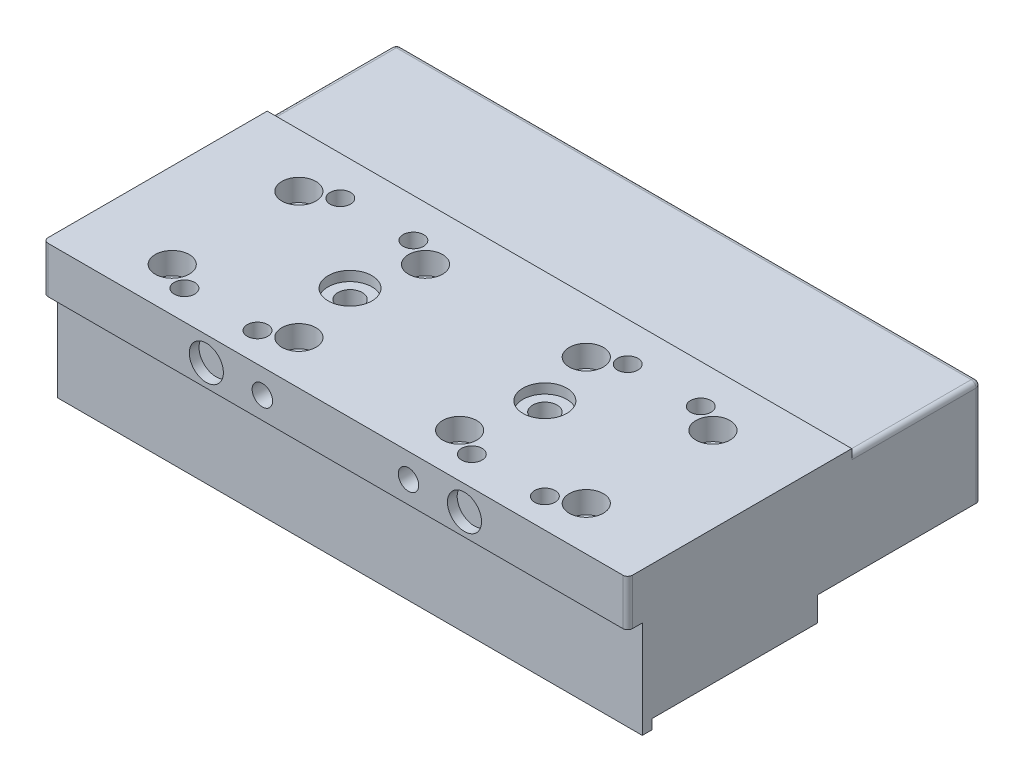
ISO-10303-21;
HEADER;
FILE_DESCRIPTION(('STEP AP214'),'2;1');
FILE_NAME('part.step','',(''),(''),'','','');
FILE_SCHEMA(('AUTOMOTIVE_DESIGN { 1 0 10303 214 1 1 1 1 }'));
ENDSEC;
DATA;
#1=APPLICATION_CONTEXT('core data for automotive mechanical design processes');
#2=APPLICATION_PROTOCOL_DEFINITION('international standard','automotive_design',2000,#1);
#3=PRODUCT_CONTEXT('',#1,'mechanical');
#4=PRODUCT('Part','Part','',(#3));
#5=PRODUCT_RELATED_PRODUCT_CATEGORY('part','',(#4));
#6=PRODUCT_DEFINITION_FORMATION('','',#4);
#7=PRODUCT_DEFINITION_CONTEXT('part definition',#1,'design');
#8=PRODUCT_DEFINITION('design','',#6,#7);
#9=PRODUCT_DEFINITION_SHAPE('','',#8);
#10=(LENGTH_UNIT() NAMED_UNIT(*) SI_UNIT(.MILLI.,.METRE.));
#11=(NAMED_UNIT(*) PLANE_ANGLE_UNIT() SI_UNIT($,.RADIAN.));
#12=(NAMED_UNIT(*) SI_UNIT($,.STERADIAN.) SOLID_ANGLE_UNIT());
#13=UNCERTAINTY_MEASURE_WITH_UNIT(LENGTH_MEASURE(1.E-05),#10,'distance_accuracy_value','');
#14=(GEOMETRIC_REPRESENTATION_CONTEXT(3) GLOBAL_UNCERTAINTY_ASSIGNED_CONTEXT((#13)) GLOBAL_UNIT_ASSIGNED_CONTEXT((#10,
#11,#12)) REPRESENTATION_CONTEXT('',''));
#15=CARTESIAN_POINT('',(0.,0.,0.));
#16=DIRECTION('',(0.,0.,1.));
#17=DIRECTION('',(1.,0.,0.));
#18=AXIS2_PLACEMENT_3D('',#15,#16,#17);
#19=CARTESIAN_POINT('',(-60.,22.5,-36.25));
#20=DIRECTION('',(0.,0.,1.));
#21=DIRECTION('',(1.,0.,0.));
#22=AXIS2_PLACEMENT_3D('',#19,#20,#21);
#23=PLANE('',#22);
#24=CARTESIAN_POINT('',(2.99999999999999,17.5,-36.25));
#25=DIRECTION('',(0.,0.,-1.));
#26=DIRECTION('',(-1.,0.,0.));
#27=AXIS2_PLACEMENT_3D('',#24,#25,#26);
#28=CIRCLE('',#27,2.09999999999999);
#29=CARTESIAN_POINT('',(0.9,17.5,-36.25));
#30=VERTEX_POINT('',#29);
#31=EDGE_CURVE('E240',#30,#30,#28,.T.);
#32=ORIENTED_EDGE('',*,*,#31,.F.);
#33=EDGE_LOOP('',(#32));
#34=FACE_BOUND('',#33,.T.);
#35=CARTESIAN_POINT('',(15.,17.5,-36.25));
#36=DIRECTION('',(0.,0.,-1.));
#37=DIRECTION('',(-1.,0.,0.));
#38=AXIS2_PLACEMENT_3D('',#35,#36,#37);
#39=CIRCLE('',#38,2.1);
#40=CARTESIAN_POINT('',(12.9,17.5,-36.25));
#41=VERTEX_POINT('',#40);
#42=EDGE_CURVE('E346',#41,#41,#39,.T.);
#43=ORIENTED_EDGE('',*,*,#42,.F.);
#44=EDGE_LOOP('',(#43));
#45=FACE_BOUND('',#44,.T.);
#46=CARTESIAN_POINT('',(-15.,17.5,-36.25));
#47=DIRECTION('',(0.,0.,-1.));
#48=DIRECTION('',(-1.,0.,0.));
#49=AXIS2_PLACEMENT_3D('',#46,#47,#48);
#50=CIRCLE('',#49,2.1);
#51=CARTESIAN_POINT('',(-17.1,17.5,-36.25));
#52=VERTEX_POINT('',#51);
#53=EDGE_CURVE('E352',#52,#52,#50,.T.);
#54=ORIENTED_EDGE('',*,*,#53,.F.);
#55=EDGE_LOOP('',(#54));
#56=FACE_BOUND('',#55,.T.);
#57=CARTESIAN_POINT('',(39.,6.5,-36.25));
#58=DIRECTION('',(0.,0.,-1.));
#59=DIRECTION('',(-1.,0.,0.));
#60=AXIS2_PLACEMENT_3D('',#57,#58,#59);
#61=CIRCLE('',#60,2.025);
#62=CARTESIAN_POINT('',(36.975,6.5,-36.25));
#63=VERTEX_POINT('',#62);
#64=EDGE_CURVE('E358',#63,#63,#61,.T.);
#65=ORIENTED_EDGE('',*,*,#64,.F.);
#66=EDGE_LOOP('',(#65));
#67=FACE_BOUND('',#66,.T.);
#68=CARTESIAN_POINT('',(-39.,6.5,-36.25));
#69=DIRECTION('',(0.,0.,-1.));
#70=DIRECTION('',(-1.,0.,0.));
#71=AXIS2_PLACEMENT_3D('',#68,#69,#70);
#72=CIRCLE('',#71,2.025);
#73=CARTESIAN_POINT('',(-41.025,6.5,-36.25));
#74=VERTEX_POINT('',#73);
#75=EDGE_CURVE('E367',#74,#74,#72,.T.);
#76=ORIENTED_EDGE('',*,*,#75,.F.);
#77=EDGE_LOOP('',(#76));
#78=FACE_BOUND('',#77,.T.);
#79=DIRECTION('',(-1.,0.,0.));
#80=VECTOR('',#79,1.);
#81=CARTESIAN_POINT('',(-60.,0.,-36.25));
#82=LINE('',#81,#80);
#83=CARTESIAN_POINT('',(59.,0.,-36.25));
#84=VERTEX_POINT('',#83);
#85=CARTESIAN_POINT('',(-59.,0.,-36.25));
#86=VERTEX_POINT('',#85);
#87=EDGE_CURVE('E521',#84,#86,#82,.T.);
#88=ORIENTED_EDGE('',*,*,#87,.T.);
#89=DIRECTION('',(0.,-1.,0.));
#90=VECTOR('',#89,1.);
#91=CARTESIAN_POINT('',(-59.,22.5,-36.25));
#92=LINE('',#91,#90);
#93=CARTESIAN_POINT('',(-59.,20.5,-36.25));
#94=VERTEX_POINT('',#93);
#95=EDGE_CURVE('E560',#86,#94,#92,.F.);
#96=ORIENTED_EDGE('',*,*,#95,.T.);
#97=DIRECTION('',(-1.,0.,0.));
#98=VECTOR('',#97,1.);
#99=CARTESIAN_POINT('',(60.,20.5,-36.25));
#100=LINE('',#99,#98);
#101=CARTESIAN_POINT('',(59.,20.5,-36.25));
#102=VERTEX_POINT('',#101);
#103=EDGE_CURVE('E558',#94,#102,#100,.F.);
#104=ORIENTED_EDGE('',*,*,#103,.T.);
#105=DIRECTION('',(0.,-1.,0.));
#106=VECTOR('',#105,1.);
#107=CARTESIAN_POINT('',(59.,22.5,-36.25));
#108=LINE('',#107,#106);
#109=EDGE_CURVE('E556',#102,#84,#108,.T.);
#110=ORIENTED_EDGE('',*,*,#109,.T.);
#111=EDGE_LOOP('',(#88,#96,#104,#110));
#112=FACE_BOUND('',#111,.T.);
#113=ADVANCED_FACE('F39',(#34,#45,#56,#67,#78,#112),#23,.F.);
#114=CARTESIAN_POINT('',(60.,22.5,-36.25));
#115=DIRECTION('',(-1.,0.,0.));
#116=DIRECTION('',(0.,0.,1.));
#117=AXIS2_PLACEMENT_3D('',#114,#115,#116);
#118=PLANE('',#117);
#119=DIRECTION('',(0.,1.,0.));
#120=VECTOR('',#119,1.);
#121=CARTESIAN_POINT('',(60.,-5.,31.25));
#122=LINE('',#121,#120);
#123=CARTESIAN_POINT('',(60.,-7.,31.25));
#124=VERTEX_POINT('',#123);
#125=CARTESIAN_POINT('',(60.,-5.,31.25));
#126=VERTEX_POINT('',#125);
#127=EDGE_CURVE('E684',#124,#126,#122,.T.);
#128=ORIENTED_EDGE('',*,*,#127,.T.);
#129=DIRECTION('',(0.,0.,-1.));
#130=VECTOR('',#129,1.);
#131=CARTESIAN_POINT('',(60.,-5.,-2.75000000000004));
#132=LINE('',#131,#130);
#133=CARTESIAN_POINT('',(60.,-5.,-2.75000000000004));
#134=VERTEX_POINT('',#133);
#135=EDGE_CURVE('E56',#126,#134,#132,.T.);
#136=ORIENTED_EDGE('',*,*,#135,.T.);
#137=DIRECTION('',(0.,1.,0.));
#138=VECTOR('',#137,1.);
#139=CARTESIAN_POINT('',(60.,13.,-2.75000000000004));
#140=LINE('',#139,#138);
#141=CARTESIAN_POINT('',(60.,0.,-2.75));
#142=VERTEX_POINT('',#141);
#143=EDGE_CURVE('E480',#134,#142,#140,.T.);
#144=ORIENTED_EDGE('',*,*,#143,.T.);
#145=DIRECTION('',(0.,0.,-1.));
#146=VECTOR('',#145,1.);
#147=CARTESIAN_POINT('',(60.,0.,-36.25));
#148=LINE('',#147,#146);
#149=CARTESIAN_POINT('',(60.,0.,-35.25));
#150=VERTEX_POINT('',#149);
#151=EDGE_CURVE('E507',#142,#150,#148,.T.);
#152=ORIENTED_EDGE('',*,*,#151,.T.);
#153=DIRECTION('',(0.,-1.,0.));
#154=VECTOR('',#153,1.);
#155=CARTESIAN_POINT('',(60.,22.5,-35.25));
#156=LINE('',#155,#154);
#157=CARTESIAN_POINT('',(60.,20.5,-35.25));
#158=VERTEX_POINT('',#157);
#159=EDGE_CURVE('E518',#150,#158,#156,.F.);
#160=ORIENTED_EDGE('',*,*,#159,.T.);
#161=DIRECTION('',(0.,0.,-1.));
#162=VECTOR('',#161,1.);
#163=CARTESIAN_POINT('',(60.,20.5,-9.75));
#164=LINE('',#163,#162);
#165=CARTESIAN_POINT('',(60.,20.5,-9.75));
#166=VERTEX_POINT('',#165);
#167=EDGE_CURVE('E526',#158,#166,#164,.F.);
#168=ORIENTED_EDGE('',*,*,#167,.T.);
#169=DIRECTION('',(0.,1.,0.));
#170=VECTOR('',#169,1.);
#171=CARTESIAN_POINT('',(60.,21.5,-9.75));
#172=LINE('',#171,#170);
#173=CARTESIAN_POINT('',(60.,22.5,-9.75));
#174=VERTEX_POINT('',#173);
#175=EDGE_CURVE('E504',#166,#174,#172,.T.);
#176=ORIENTED_EDGE('',*,*,#175,.T.);
#177=DIRECTION('',(0.,0.,-1.));
#178=VECTOR('',#177,1.);
#179=CARTESIAN_POINT('',(60.,22.5,-36.25));
#180=LINE('',#179,#178);
#181=CARTESIAN_POINT('',(60.,22.5,35.25));
#182=VERTEX_POINT('',#181);
#183=EDGE_CURVE('E509',#182,#174,#180,.T.);
#184=ORIENTED_EDGE('',*,*,#183,.F.);
#185=DIRECTION('',(0.,-1.,0.));
#186=VECTOR('',#185,1.);
#187=CARTESIAN_POINT('',(60.,22.5,35.25));
#188=LINE('',#187,#186);
#189=CARTESIAN_POINT('',(60.,13.,35.25));
#190=VERTEX_POINT('',#189);
#191=EDGE_CURVE('E529',#182,#190,#188,.T.);
#192=ORIENTED_EDGE('',*,*,#191,.T.);
#193=DIRECTION('',(0.,0.,1.));
#194=VECTOR('',#193,1.);
#195=CARTESIAN_POINT('',(60.,13.,36.25));
#196=LINE('',#195,#194);
#197=CARTESIAN_POINT('',(60.,13.,33.25));
#198=VERTEX_POINT('',#197);
#199=EDGE_CURVE('E487',#198,#190,#196,.T.);
#200=ORIENTED_EDGE('',*,*,#199,.F.);
#201=DIRECTION('',(0.,-1.,0.));
#202=VECTOR('',#201,1.);
#203=CARTESIAN_POINT('',(60.,13.,33.25));
#204=LINE('',#203,#202);
#205=CARTESIAN_POINT('',(60.,-7.,33.25));
#206=VERTEX_POINT('',#205);
#207=EDGE_CURVE('E473',#198,#206,#204,.T.);
#208=ORIENTED_EDGE('',*,*,#207,.T.);
#209=DIRECTION('',(0.,0.,-1.));
#210=VECTOR('',#209,1.);
#211=CARTESIAN_POINT('',(60.,-7.,33.25));
#212=LINE('',#211,#210);
#213=EDGE_CURVE('E244',#206,#124,#212,.T.);
#214=ORIENTED_EDGE('',*,*,#213,.T.);
#215=EDGE_LOOP('',(#128,#136,#144,#152,#160,#168,#176,#184,#192,#200,#208,#214));
#216=FACE_BOUND('',#215,.T.);
#217=ADVANCED_FACE('F609',(#216),#118,.F.);
#218=CARTESIAN_POINT('',(-60.,22.5,-36.25));
#219=DIRECTION('',(1.,0.,0.));
#220=DIRECTION('',(0.,0.,-1.));
#221=AXIS2_PLACEMENT_3D('',#218,#219,#220);
#222=PLANE('',#221);
#223=DIRECTION('',(0.,0.,-1.));
#224=VECTOR('',#223,1.);
#225=CARTESIAN_POINT('',(-60.,13.,36.25));
#226=LINE('',#225,#224);
#227=CARTESIAN_POINT('',(-60.,13.,35.25));
#228=VERTEX_POINT('',#227);
#229=CARTESIAN_POINT('',(-60.,13.,33.25));
#230=VERTEX_POINT('',#229);
#231=EDGE_CURVE('E493',#228,#230,#226,.T.);
#232=ORIENTED_EDGE('',*,*,#231,.F.);
#233=DIRECTION('',(0.,-1.,0.));
#234=VECTOR('',#233,1.);
#235=CARTESIAN_POINT('',(-60.,22.5,35.25));
#236=LINE('',#235,#234);
#237=CARTESIAN_POINT('',(-60.,22.5,35.25));
#238=VERTEX_POINT('',#237);
#239=EDGE_CURVE('E550',#228,#238,#236,.F.);
#240=ORIENTED_EDGE('',*,*,#239,.T.);
#241=DIRECTION('',(0.,0.,1.));
#242=VECTOR('',#241,1.);
#243=CARTESIAN_POINT('',(-60.,22.5,-36.25));
#244=LINE('',#243,#242);
#245=CARTESIAN_POINT('',(-60.,22.5,-9.75));
#246=VERTEX_POINT('',#245);
#247=EDGE_CURVE('E511',#246,#238,#244,.T.);
#248=ORIENTED_EDGE('',*,*,#247,.F.);
#249=DIRECTION('',(0.,1.,0.));
#250=VECTOR('',#249,1.);
#251=CARTESIAN_POINT('',(-60.,21.5,-9.75));
#252=LINE('',#251,#250);
#253=CARTESIAN_POINT('',(-60.,20.5,-9.75));
#254=VERTEX_POINT('',#253);
#255=EDGE_CURVE('E501',#254,#246,#252,.T.);
#256=ORIENTED_EDGE('',*,*,#255,.F.);
#257=DIRECTION('',(0.,0.,1.));
#258=VECTOR('',#257,1.);
#259=CARTESIAN_POINT('',(-60.,20.5,-36.25));
#260=LINE('',#259,#258);
#261=CARTESIAN_POINT('',(-60.,20.5,-35.25));
#262=VERTEX_POINT('',#261);
#263=EDGE_CURVE('E545',#254,#262,#260,.F.);
#264=ORIENTED_EDGE('',*,*,#263,.T.);
#265=DIRECTION('',(0.,-1.,0.));
#266=VECTOR('',#265,1.);
#267=CARTESIAN_POINT('',(-60.,22.5,-35.25));
#268=LINE('',#267,#266);
#269=CARTESIAN_POINT('',(-60.,0.,-35.25));
#270=VERTEX_POINT('',#269);
#271=EDGE_CURVE('E547',#262,#270,#268,.T.);
#272=ORIENTED_EDGE('',*,*,#271,.T.);
#273=DIRECTION('',(0.,0.,1.));
#274=VECTOR('',#273,1.);
#275=CARTESIAN_POINT('',(-60.,0.,-36.25));
#276=LINE('',#275,#274);
#277=CARTESIAN_POINT('',(-60.,0.,-2.75000000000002));
#278=VERTEX_POINT('',#277);
#279=EDGE_CURVE('E512',#270,#278,#276,.T.);
#280=ORIENTED_EDGE('',*,*,#279,.T.);
#281=DIRECTION('',(0.,-1.,0.));
#282=VECTOR('',#281,1.);
#283=CARTESIAN_POINT('',(-60.,13.,-2.75000000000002));
#284=LINE('',#283,#282);
#285=CARTESIAN_POINT('',(-60.,-5.,-2.75000000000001));
#286=VERTEX_POINT('',#285);
#287=EDGE_CURVE('E219',#278,#286,#284,.T.);
#288=ORIENTED_EDGE('',*,*,#287,.T.);
#289=DIRECTION('',(0.,0.,1.));
#290=VECTOR('',#289,1.);
#291=CARTESIAN_POINT('',(-60.,-5.,-2.75000000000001));
#292=LINE('',#291,#290);
#293=CARTESIAN_POINT('',(-60.,-5.,31.25));
#294=VERTEX_POINT('',#293);
#295=EDGE_CURVE('E211',#286,#294,#292,.T.);
#296=ORIENTED_EDGE('',*,*,#295,.T.);
#297=DIRECTION('',(0.,-1.,0.));
#298=VECTOR('',#297,1.);
#299=CARTESIAN_POINT('',(-60.,-5.,31.25));
#300=LINE('',#299,#298);
#301=CARTESIAN_POINT('',(-60.,-7.,31.25));
#302=VERTEX_POINT('',#301);
#303=EDGE_CURVE('E216',#294,#302,#300,.T.);
#304=ORIENTED_EDGE('',*,*,#303,.T.);
#305=DIRECTION('',(0.,0.,1.));
#306=VECTOR('',#305,1.);
#307=CARTESIAN_POINT('',(-60.,-7.,33.25));
#308=LINE('',#307,#306);
#309=CARTESIAN_POINT('',(-60.,-7.,33.25));
#310=VERTEX_POINT('',#309);
#311=EDGE_CURVE('E230',#302,#310,#308,.T.);
#312=ORIENTED_EDGE('',*,*,#311,.T.);
#313=DIRECTION('',(0.,1.,0.));
#314=VECTOR('',#313,1.);
#315=CARTESIAN_POINT('',(-60.,13.,33.25));
#316=LINE('',#315,#314);
#317=EDGE_CURVE('E472',#310,#230,#316,.T.);
#318=ORIENTED_EDGE('',*,*,#317,.T.);
#319=EDGE_LOOP('',(#232,#240,#248,#256,#264,#272,#280,#288,#296,#304,#312,#318));
#320=FACE_BOUND('',#319,.T.);
#321=ADVANCED_FACE('F214',(#320),#222,.F.);
#322=CARTESIAN_POINT('',(-60.,22.5,36.25));
#323=DIRECTION('',(0.,0.,-1.));
#324=DIRECTION('',(-1.,0.,0.));
#325=AXIS2_PLACEMENT_3D('',#322,#323,#324);
#326=PLANE('',#325);
#327=CARTESIAN_POINT('',(26.5,17.5,36.25));
#328=DIRECTION('',(0.,0.,1.));
#329=DIRECTION('',(1.,0.,0.));
#330=AXIS2_PLACEMENT_3D('',#327,#328,#329);
#331=CIRCLE('',#330,3.5);
#332=CARTESIAN_POINT('',(30.,17.5,36.25));
#333=VERTEX_POINT('',#332);
#334=EDGE_CURVE('E277',#333,#333,#331,.T.);
#335=ORIENTED_EDGE('',*,*,#334,.F.);
#336=EDGE_LOOP('',(#335));
#337=FACE_BOUND('',#336,.T.);
#338=CARTESIAN_POINT('',(-26.5,17.5,36.25));
#339=DIRECTION('',(0.,0.,1.));
#340=DIRECTION('',(1.,0.,0.));
#341=AXIS2_PLACEMENT_3D('',#338,#339,#340);
#342=CIRCLE('',#341,3.5);
#343=CARTESIAN_POINT('',(-23.,17.5,36.25));
#344=VERTEX_POINT('',#343);
#345=EDGE_CURVE('E276',#344,#344,#342,.T.);
#346=ORIENTED_EDGE('',*,*,#345,.F.);
#347=EDGE_LOOP('',(#346));
#348=FACE_BOUND('',#347,.T.);
#349=CARTESIAN_POINT('',(-15.,17.5,36.25));
#350=DIRECTION('',(0.,0.,1.));
#351=DIRECTION('',(1.,0.,0.));
#352=AXIS2_PLACEMENT_3D('',#349,#350,#351);
#353=CIRCLE('',#352,2.09999999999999);
#354=CARTESIAN_POINT('',(-12.9,17.5,36.25));
#355=VERTEX_POINT('',#354);
#356=EDGE_CURVE('E284',#355,#355,#353,.T.);
#357=ORIENTED_EDGE('',*,*,#356,.F.);
#358=EDGE_LOOP('',(#357));
#359=FACE_BOUND('',#358,.T.);
#360=CARTESIAN_POINT('',(15.,17.5,36.25));
#361=DIRECTION('',(0.,0.,1.));
#362=DIRECTION('',(1.,0.,0.));
#363=AXIS2_PLACEMENT_3D('',#360,#361,#362);
#364=CIRCLE('',#363,2.09999999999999);
#365=CARTESIAN_POINT('',(17.1,17.5,36.25));
#366=VERTEX_POINT('',#365);
#367=EDGE_CURVE('E292',#366,#366,#364,.T.);
#368=ORIENTED_EDGE('',*,*,#367,.F.);
#369=EDGE_LOOP('',(#368));
#370=FACE_BOUND('',#369,.T.);
#371=DIRECTION('',(-1.,0.,0.));
#372=VECTOR('',#371,1.);
#373=CARTESIAN_POINT('',(60.,13.,36.25));
#374=LINE('',#373,#372);
#375=CARTESIAN_POINT('',(59.,13.,36.25));
#376=VERTEX_POINT('',#375);
#377=CARTESIAN_POINT('',(-59.,13.,36.25));
#378=VERTEX_POINT('',#377);
#379=EDGE_CURVE('E490',#376,#378,#374,.T.);
#380=ORIENTED_EDGE('',*,*,#379,.F.);
#381=DIRECTION('',(0.,-1.,0.));
#382=VECTOR('',#381,1.);
#383=CARTESIAN_POINT('',(59.,22.5,36.25));
#384=LINE('',#383,#382);
#385=CARTESIAN_POINT('',(59.,22.5,36.25));
#386=VERTEX_POINT('',#385);
#387=EDGE_CURVE('E539',#376,#386,#384,.F.);
#388=ORIENTED_EDGE('',*,*,#387,.T.);
#389=DIRECTION('',(1.,0.,0.));
#390=VECTOR('',#389,1.);
#391=CARTESIAN_POINT('',(-60.,22.5,36.25));
#392=LINE('',#391,#390);
#393=CARTESIAN_POINT('',(-59.,22.5,36.25));
#394=VERTEX_POINT('',#393);
#395=EDGE_CURVE('E515',#394,#386,#392,.T.);
#396=ORIENTED_EDGE('',*,*,#395,.F.);
#397=DIRECTION('',(0.,-1.,0.));
#398=VECTOR('',#397,1.);
#399=CARTESIAN_POINT('',(-59.,22.5,36.25));
#400=LINE('',#399,#398);
#401=EDGE_CURVE('E536',#394,#378,#400,.T.);
#402=ORIENTED_EDGE('',*,*,#401,.T.);
#403=EDGE_LOOP('',(#380,#388,#396,#402));
#404=FACE_BOUND('',#403,.T.);
#405=ADVANCED_FACE('F704',(#337,#348,#359,#370,#404),#326,.F.);
#406=CARTESIAN_POINT('',(0.,22.5,0.));
#407=DIRECTION('',(0.,1.,0.));
#408=DIRECTION('',(0.,0.,1.));
#409=AXIS2_PLACEMENT_3D('',#406,#407,#408);
#410=PLANE('',#409);
#411=CARTESIAN_POINT('',(20.,22.5,13.25));
#412=DIRECTION('',(0.,-1.,0.));
#413=DIRECTION('',(0.,0.,-1.));
#414=AXIS2_PLACEMENT_3D('',#411,#412,#413);
#415=CIRCLE('',#414,4.5);
#416=CARTESIAN_POINT('',(20.,22.5,8.75));
#417=VERTEX_POINT('',#416);
#418=EDGE_CURVE('E264',#417,#417,#415,.T.);
#419=ORIENTED_EDGE('',*,*,#418,.T.);
#420=EDGE_LOOP('',(#419));
#421=FACE_BOUND('',#420,.T.);
#422=CARTESIAN_POINT('',(-20.,22.5,13.25));
#423=DIRECTION('',(0.,-1.,0.));
#424=DIRECTION('',(0.,0.,-1.));
#425=AXIS2_PLACEMENT_3D('',#422,#423,#424);
#426=CIRCLE('',#425,4.5);
#427=CARTESIAN_POINT('',(-20.,22.5,8.75));
#428=VERTEX_POINT('',#427);
#429=EDGE_CURVE('E263',#428,#428,#426,.T.);
#430=ORIENTED_EDGE('',*,*,#429,.T.);
#431=EDGE_LOOP('',(#430));
#432=FACE_BOUND('',#431,.T.);
#433=CARTESIAN_POINT('',(-37.,22.5,-1.75));
#434=DIRECTION('',(0.,1.,0.));
#435=DIRECTION('',(0.,0.,1.));
#436=AXIS2_PLACEMENT_3D('',#433,#434,#435);
#437=CIRCLE('',#436,2.1);
#438=CARTESIAN_POINT('',(-37.,22.5,0.349999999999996));
#439=VERTEX_POINT('',#438);
#440=EDGE_CURVE('E298',#439,#439,#437,.T.);
#441=ORIENTED_EDGE('',*,*,#440,.F.);
#442=EDGE_LOOP('',(#441));
#443=FACE_BOUND('',#442,.T.);
#444=CARTESIAN_POINT('',(-22.,22.5,-1.75));
#445=DIRECTION('',(0.,1.,0.));
#446=DIRECTION('',(0.,0.,1.));
#447=AXIS2_PLACEMENT_3D('',#444,#445,#446);
#448=CIRCLE('',#447,2.1);
#449=CARTESIAN_POINT('',(-22.,22.5,0.349999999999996));
#450=VERTEX_POINT('',#449);
#451=EDGE_CURVE('E304',#450,#450,#448,.T.);
#452=ORIENTED_EDGE('',*,*,#451,.F.);
#453=EDGE_LOOP('',(#452));
#454=FACE_BOUND('',#453,.T.);
#455=CARTESIAN_POINT('',(22.,22.5,-1.75));
#456=DIRECTION('',(0.,1.,0.));
#457=DIRECTION('',(0.,0.,1.));
#458=AXIS2_PLACEMENT_3D('',#455,#456,#457);
#459=CIRCLE('',#458,2.1);
#460=CARTESIAN_POINT('',(22.,22.5,0.349999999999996));
#461=VERTEX_POINT('',#460);
#462=EDGE_CURVE('E310',#461,#461,#459,.T.);
#463=ORIENTED_EDGE('',*,*,#462,.F.);
#464=EDGE_LOOP('',(#463));
#465=FACE_BOUND('',#464,.T.);
#466=CARTESIAN_POINT('',(37.,22.5,-1.75));
#467=DIRECTION('',(0.,1.,0.));
#468=DIRECTION('',(0.,0.,1.));
#469=AXIS2_PLACEMENT_3D('',#466,#467,#468);
#470=CIRCLE('',#469,2.1);
#471=CARTESIAN_POINT('',(37.,22.5,0.349999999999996));
#472=VERTEX_POINT('',#471);
#473=EDGE_CURVE('E316',#472,#472,#470,.T.);
#474=ORIENTED_EDGE('',*,*,#473,.F.);
#475=EDGE_LOOP('',(#474));
#476=FACE_BOUND('',#475,.T.);
#477=CARTESIAN_POINT('',(37.,22.5,30.25));
#478=DIRECTION('',(0.,1.,0.));
#479=DIRECTION('',(0.,0.,1.));
#480=AXIS2_PLACEMENT_3D('',#477,#478,#479);
#481=CIRCLE('',#480,2.1);
#482=CARTESIAN_POINT('',(37.,22.5,32.35));
#483=VERTEX_POINT('',#482);
#484=EDGE_CURVE('E322',#483,#483,#481,.T.);
#485=ORIENTED_EDGE('',*,*,#484,.F.);
#486=EDGE_LOOP('',(#485));
#487=FACE_BOUND('',#486,.T.);
#488=CARTESIAN_POINT('',(22.,22.5,30.25));
#489=DIRECTION('',(0.,1.,0.));
#490=DIRECTION('',(0.,0.,1.));
#491=AXIS2_PLACEMENT_3D('',#488,#489,#490);
#492=CIRCLE('',#491,2.1);
#493=CARTESIAN_POINT('',(22.,22.5,32.35));
#494=VERTEX_POINT('',#493);
#495=EDGE_CURVE('E328',#494,#494,#492,.T.);
#496=ORIENTED_EDGE('',*,*,#495,.F.);
#497=EDGE_LOOP('',(#496));
#498=FACE_BOUND('',#497,.T.);
#499=CARTESIAN_POINT('',(-22.,22.5,30.25));
#500=DIRECTION('',(0.,1.,0.));
#501=DIRECTION('',(0.,0.,1.));
#502=AXIS2_PLACEMENT_3D('',#499,#500,#501);
#503=CIRCLE('',#502,2.1);
#504=CARTESIAN_POINT('',(-22.,22.5,32.35));
#505=VERTEX_POINT('',#504);
#506=EDGE_CURVE('E334',#505,#505,#503,.T.);
#507=ORIENTED_EDGE('',*,*,#506,.F.);
#508=EDGE_LOOP('',(#507));
#509=FACE_BOUND('',#508,.T.);
#510=CARTESIAN_POINT('',(-37.,22.5,30.25));
#511=DIRECTION('',(0.,1.,0.));
#512=DIRECTION('',(0.,0.,1.));
#513=AXIS2_PLACEMENT_3D('',#510,#511,#512);
#514=CIRCLE('',#513,2.1);
#515=CARTESIAN_POINT('',(-37.,22.5,32.35));
#516=VERTEX_POINT('',#515);
#517=EDGE_CURVE('E340',#516,#516,#514,.T.);
#518=ORIENTED_EDGE('',*,*,#517,.F.);
#519=EDGE_LOOP('',(#518));
#520=FACE_BOUND('',#519,.T.);
#521=CARTESIAN_POINT('',(-42.5,22.5,27.25));
#522=DIRECTION('',(0.,1.,0.));
#523=DIRECTION('',(0.,0.,1.));
#524=AXIS2_PLACEMENT_3D('',#521,#522,#523);
#525=CIRCLE('',#524,3.5);
#526=CARTESIAN_POINT('',(-42.5,22.5,30.75));
#527=VERTEX_POINT('',#526);
#528=EDGE_CURVE('E376',#527,#527,#525,.T.);
#529=ORIENTED_EDGE('',*,*,#528,.F.);
#530=EDGE_LOOP('',(#529));
#531=FACE_BOUND('',#530,.T.);
#532=CARTESIAN_POINT('',(-42.5,22.5,1.25));
#533=DIRECTION('',(0.,1.,0.));
#534=DIRECTION('',(0.,0.,1.));
#535=AXIS2_PLACEMENT_3D('',#532,#533,#534);
#536=CIRCLE('',#535,3.5);
#537=CARTESIAN_POINT('',(-42.5,22.5,4.75));
#538=VERTEX_POINT('',#537);
#539=EDGE_CURVE('E388',#538,#538,#536,.T.);
#540=ORIENTED_EDGE('',*,*,#539,.F.);
#541=EDGE_LOOP('',(#540));
#542=FACE_BOUND('',#541,.T.);
#543=CARTESIAN_POINT('',(-16.5,22.5,1.25));
#544=DIRECTION('',(0.,1.,0.));
#545=DIRECTION('',(0.,0.,1.));
#546=AXIS2_PLACEMENT_3D('',#543,#544,#545);
#547=CIRCLE('',#546,3.5);
#548=CARTESIAN_POINT('',(-16.5,22.5,4.75));
#549=VERTEX_POINT('',#548);
#550=EDGE_CURVE('E400',#549,#549,#547,.T.);
#551=ORIENTED_EDGE('',*,*,#550,.F.);
#552=EDGE_LOOP('',(#551));
#553=FACE_BOUND('',#552,.T.);
#554=CARTESIAN_POINT('',(-16.5,22.5,27.25));
#555=DIRECTION('',(0.,1.,0.));
#556=DIRECTION('',(0.,0.,1.));
#557=AXIS2_PLACEMENT_3D('',#554,#555,#556);
#558=CIRCLE('',#557,3.5);
#559=CARTESIAN_POINT('',(-16.5,22.5,30.75));
#560=VERTEX_POINT('',#559);
#561=EDGE_CURVE('E412',#560,#560,#558,.T.);
#562=ORIENTED_EDGE('',*,*,#561,.F.);
#563=EDGE_LOOP('',(#562));
#564=FACE_BOUND('',#563,.T.);
#565=CARTESIAN_POINT('',(16.5,22.5,1.25));
#566=DIRECTION('',(0.,1.,0.));
#567=DIRECTION('',(0.,0.,1.));
#568=AXIS2_PLACEMENT_3D('',#565,#566,#567);
#569=CIRCLE('',#568,3.5);
#570=CARTESIAN_POINT('',(16.5,22.5,4.75));
#571=VERTEX_POINT('',#570);
#572=EDGE_CURVE('E424',#571,#571,#569,.T.);
#573=ORIENTED_EDGE('',*,*,#572,.F.);
#574=EDGE_LOOP('',(#573));
#575=FACE_BOUND('',#574,.T.);
#576=CARTESIAN_POINT('',(16.5,22.5,27.25));
#577=DIRECTION('',(0.,1.,0.));
#578=DIRECTION('',(0.,0.,1.));
#579=AXIS2_PLACEMENT_3D('',#576,#577,#578);
#580=CIRCLE('',#579,3.5);
#581=CARTESIAN_POINT('',(16.5,22.5,30.75));
#582=VERTEX_POINT('',#581);
#583=EDGE_CURVE('E436',#582,#582,#580,.T.);
#584=ORIENTED_EDGE('',*,*,#583,.F.);
#585=EDGE_LOOP('',(#584));
#586=FACE_BOUND('',#585,.T.);
#587=CARTESIAN_POINT('',(42.5,22.5,27.25));
#588=DIRECTION('',(0.,1.,0.));
#589=DIRECTION('',(0.,0.,1.));
#590=AXIS2_PLACEMENT_3D('',#587,#588,#589);
#591=CIRCLE('',#590,3.5);
#592=CARTESIAN_POINT('',(42.5,22.5,30.75));
#593=VERTEX_POINT('',#592);
#594=EDGE_CURVE('E448',#593,#593,#591,.T.);
#595=ORIENTED_EDGE('',*,*,#594,.F.);
#596=EDGE_LOOP('',(#595));
#597=FACE_BOUND('',#596,.T.);
#598=CARTESIAN_POINT('',(42.5,22.5,1.25));
#599=DIRECTION('',(0.,1.,0.));
#600=DIRECTION('',(0.,0.,1.));
#601=AXIS2_PLACEMENT_3D('',#598,#599,#600);
#602=CIRCLE('',#601,3.5);
#603=CARTESIAN_POINT('',(42.5,22.5,4.75));
#604=VERTEX_POINT('',#603);
#605=EDGE_CURVE('E460',#604,#604,#602,.T.);
#606=ORIENTED_EDGE('',*,*,#605,.F.);
#607=EDGE_LOOP('',(#606));
#608=FACE_BOUND('',#607,.T.);
#609=ORIENTED_EDGE('',*,*,#395,.T.);
#610=CARTESIAN_POINT('',(59.,22.5,35.25));
#611=DIRECTION('',(0.,1.,0.));
#612=DIRECTION('',(0.,0.,1.));
#613=AXIS2_PLACEMENT_3D('',#610,#611,#612);
#614=CIRCLE('',#613,1.);
#615=EDGE_CURVE('E543',#386,#182,#614,.T.);
#616=ORIENTED_EDGE('',*,*,#615,.T.);
#617=ORIENTED_EDGE('',*,*,#183,.T.);
#618=DIRECTION('',(1.,0.,0.));
#619=VECTOR('',#618,1.);
#620=CARTESIAN_POINT('',(-60.,22.5,-9.75));
#621=LINE('',#620,#619);
#622=EDGE_CURVE('E495',#246,#174,#621,.T.);
#623=ORIENTED_EDGE('',*,*,#622,.F.);
#624=ORIENTED_EDGE('',*,*,#247,.T.);
#625=CARTESIAN_POINT('',(-59.,22.5,35.25));
#626=DIRECTION('',(0.,1.,0.));
#627=DIRECTION('',(0.,0.,1.));
#628=AXIS2_PLACEMENT_3D('',#625,#626,#627);
#629=CIRCLE('',#628,1.);
#630=EDGE_CURVE('E541',#238,#394,#629,.T.);
#631=ORIENTED_EDGE('',*,*,#630,.T.);
#632=EDGE_LOOP('',(#609,#616,#617,#623,#624,#631));
#633=FACE_BOUND('',#632,.T.);
#634=ADVANCED_FACE('F708',(#421,#432,#443,#454,#465,#476,#487,#498,#509,#520,#531,#542,#553,
#564,#575,#586,#597,#608,#633),#410,.T.);
#635=CARTESIAN_POINT('',(0.,0.,0.));
#636=DIRECTION('',(0.,1.,0.));
#637=DIRECTION('',(0.,0.,1.));
#638=AXIS2_PLACEMENT_3D('',#635,#636,#637);
#639=PLANE('',#638);
#640=ORIENTED_EDGE('',*,*,#279,.F.);
#641=CARTESIAN_POINT('',(-59.,0.,-35.25));
#642=DIRECTION('',(0.,1.,0.));
#643=DIRECTION('',(0.,0.,1.));
#644=AXIS2_PLACEMENT_3D('',#641,#642,#643);
#645=CIRCLE('',#644,1.);
#646=EDGE_CURVE('E554',#270,#86,#645,.F.);
#647=ORIENTED_EDGE('',*,*,#646,.T.);
#648=ORIENTED_EDGE('',*,*,#87,.F.);
#649=CARTESIAN_POINT('',(59.,0.,-35.25));
#650=DIRECTION('',(0.,1.,0.));
#651=DIRECTION('',(0.,0.,1.));
#652=AXIS2_PLACEMENT_3D('',#649,#650,#651);
#653=CIRCLE('',#652,1.);
#654=EDGE_CURVE('E552',#84,#150,#653,.F.);
#655=ORIENTED_EDGE('',*,*,#654,.T.);
#656=ORIENTED_EDGE('',*,*,#151,.F.);
#657=DIRECTION('',(1.,0.,0.));
#658=VECTOR('',#657,1.);
#659=CARTESIAN_POINT('',(60.,0.,-2.75));
#660=LINE('',#659,#658);
#661=EDGE_CURVE('E486',#278,#142,#660,.T.);
#662=ORIENTED_EDGE('',*,*,#661,.F.);
#663=EDGE_LOOP('',(#640,#647,#648,#655,#656,#662));
#664=FACE_BOUND('',#663,.T.);
#665=ADVANCED_FACE('F678',(#664),#639,.F.);
#666=CARTESIAN_POINT('',(-60.,21.5,-9.75));
#667=DIRECTION('',(0.,0.,1.));
#668=DIRECTION('',(1.,0.,0.));
#669=AXIS2_PLACEMENT_3D('',#666,#667,#668);
#670=PLANE('',#669);
#671=ORIENTED_EDGE('',*,*,#622,.T.);
#672=ORIENTED_EDGE('',*,*,#175,.F.);
#673=CARTESIAN_POINT('',(59.,20.5,-9.75));
#674=DIRECTION('',(0.,0.,1.));
#675=DIRECTION('',(1.,0.,0.));
#676=AXIS2_PLACEMENT_3D('',#673,#674,#675);
#677=CIRCLE('',#676,1.);
#678=CARTESIAN_POINT('',(59.,21.5,-9.75));
#679=VERTEX_POINT('',#678);
#680=EDGE_CURVE('E11',#166,#679,#677,.T.);
#681=ORIENTED_EDGE('',*,*,#680,.T.);
#682=DIRECTION('',(1.,0.,0.));
#683=VECTOR('',#682,1.);
#684=CARTESIAN_POINT('',(-60.,21.5,-9.75));
#685=LINE('',#684,#683);
#686=CARTESIAN_POINT('',(-59.,21.5,-9.75));
#687=VERTEX_POINT('',#686);
#688=EDGE_CURVE('E498',#687,#679,#685,.T.);
#689=ORIENTED_EDGE('',*,*,#688,.F.);
#690=CARTESIAN_POINT('',(-59.,20.5,-9.75));
#691=DIRECTION('',(0.,0.,1.));
#692=DIRECTION('',(1.,0.,0.));
#693=AXIS2_PLACEMENT_3D('',#690,#691,#692);
#694=CIRCLE('',#693,1.);
#695=EDGE_CURVE('E48',#687,#254,#694,.T.);
#696=ORIENTED_EDGE('',*,*,#695,.T.);
#697=ORIENTED_EDGE('',*,*,#255,.T.);
#698=EDGE_LOOP('',(#671,#672,#681,#689,#696,#697));
#699=FACE_BOUND('',#698,.T.);
#700=ADVANCED_FACE('F665',(#699),#670,.F.);
#701=CARTESIAN_POINT('',(0.,21.5,0.));
#702=DIRECTION('',(0.,1.,0.));
#703=DIRECTION('',(0.,0.,1.));
#704=AXIS2_PLACEMENT_3D('',#701,#702,#703);
#705=PLANE('',#704);
#706=DIRECTION('',(-1.,0.,0.));
#707=VECTOR('',#706,1.);
#708=CARTESIAN_POINT('',(-60.,21.5,-35.25));
#709=LINE('',#708,#707);
#710=CARTESIAN_POINT('',(59.,21.5,-35.25));
#711=VERTEX_POINT('',#710);
#712=CARTESIAN_POINT('',(-59.,21.5,-35.25));
#713=VERTEX_POINT('',#712);
#714=EDGE_CURVE('E64',#711,#713,#709,.T.);
#715=ORIENTED_EDGE('',*,*,#714,.T.);
#716=DIRECTION('',(0.,0.,1.));
#717=VECTOR('',#716,1.);
#718=CARTESIAN_POINT('',(-59.,21.5,-9.75));
#719=LINE('',#718,#717);
#720=EDGE_CURVE('E565',#713,#687,#719,.T.);
#721=ORIENTED_EDGE('',*,*,#720,.T.);
#722=ORIENTED_EDGE('',*,*,#688,.T.);
#723=DIRECTION('',(0.,0.,-1.));
#724=VECTOR('',#723,1.);
#725=CARTESIAN_POINT('',(59.,21.5,-36.25));
#726=LINE('',#725,#724);
#727=EDGE_CURVE('E563',#679,#711,#726,.T.);
#728=ORIENTED_EDGE('',*,*,#727,.T.);
#729=EDGE_LOOP('',(#715,#721,#722,#728));
#730=FACE_BOUND('',#729,.T.);
#731=ADVANCED_FACE('F667',(#730),#705,.T.);
#732=CARTESIAN_POINT('',(0.,13.,0.));
#733=DIRECTION('',(0.,1.,0.));
#734=DIRECTION('',(0.,0.,1.));
#735=AXIS2_PLACEMENT_3D('',#732,#733,#734);
#736=PLANE('',#735);
#737=ORIENTED_EDGE('',*,*,#199,.T.);
#738=CARTESIAN_POINT('',(59.,13.,35.25));
#739=DIRECTION('',(0.,1.,0.));
#740=DIRECTION('',(0.,0.,1.));
#741=AXIS2_PLACEMENT_3D('',#738,#739,#740);
#742=CIRCLE('',#741,1.);
#743=EDGE_CURVE('E534',#190,#376,#742,.F.);
#744=ORIENTED_EDGE('',*,*,#743,.T.);
#745=ORIENTED_EDGE('',*,*,#379,.T.);
#746=CARTESIAN_POINT('',(-59.,13.,35.25));
#747=DIRECTION('',(0.,1.,0.));
#748=DIRECTION('',(0.,0.,1.));
#749=AXIS2_PLACEMENT_3D('',#746,#747,#748);
#750=CIRCLE('',#749,1.);
#751=EDGE_CURVE('E532',#378,#228,#750,.F.);
#752=ORIENTED_EDGE('',*,*,#751,.T.);
#753=ORIENTED_EDGE('',*,*,#231,.T.);
#754=DIRECTION('',(-1.,0.,0.));
#755=VECTOR('',#754,1.);
#756=CARTESIAN_POINT('',(80.591260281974,13.,33.25));
#757=LINE('',#756,#755);
#758=EDGE_CURVE('E475',#198,#230,#757,.T.);
#759=ORIENTED_EDGE('',*,*,#758,.F.);
#760=EDGE_LOOP('',(#737,#744,#745,#752,#753,#759));
#761=FACE_BOUND('',#760,.T.);
#762=ADVANCED_FACE('F698',(#761),#736,.F.);
#763=CARTESIAN_POINT('',(80.591260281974,13.,-2.75000000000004));
#764=DIRECTION('',(0.,0.,-1.));
#765=DIRECTION('',(0.,1.,0.));
#766=AXIS2_PLACEMENT_3D('',#763,#764,#765);
#767=PLANE('',#766);
#768=ORIENTED_EDGE('',*,*,#661,.T.);
#769=ORIENTED_EDGE('',*,*,#143,.F.);
#770=DIRECTION('',(-1.,0.,0.));
#771=VECTOR('',#770,1.);
#772=CARTESIAN_POINT('',(80.591260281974,-5.,-2.75000000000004));
#773=LINE('',#772,#771);
#774=EDGE_CURVE('E221',#134,#286,#773,.T.);
#775=ORIENTED_EDGE('',*,*,#774,.T.);
#776=ORIENTED_EDGE('',*,*,#287,.F.);
#777=EDGE_LOOP('',(#768,#769,#775,#776));
#778=FACE_BOUND('',#777,.T.);
#779=ADVANCED_FACE('F682',(#778),#767,.T.);
#780=CARTESIAN_POINT('',(80.591260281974,-5.,-2.75000000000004));
#781=DIRECTION('',(0.,-1.,0.));
#782=DIRECTION('',(0.,0.,-1.));
#783=AXIS2_PLACEMENT_3D('',#780,#781,#782);
#784=PLANE('',#783);
#785=CARTESIAN_POINT('',(-42.5,-5.,1.25));
#786=DIRECTION('',(0.,1.,0.));
#787=DIRECTION('',(0.,0.,1.));
#788=AXIS2_PLACEMENT_3D('',#785,#786,#787);
#789=CIRCLE('',#788,2.25);
#790=CARTESIAN_POINT('',(-42.5,-5.,3.49999999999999));
#791=VERTEX_POINT('',#790);
#792=EDGE_CURVE('E397',#791,#791,#789,.T.);
#793=ORIENTED_EDGE('',*,*,#792,.T.);
#794=EDGE_LOOP('',(#793));
#795=FACE_BOUND('',#794,.T.);
#796=CARTESIAN_POINT('',(-16.5,-5.,1.25));
#797=DIRECTION('',(0.,1.,0.));
#798=DIRECTION('',(0.,0.,1.));
#799=AXIS2_PLACEMENT_3D('',#796,#797,#798);
#800=CIRCLE('',#799,2.24999999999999);
#801=CARTESIAN_POINT('',(-16.5,-5.,3.49999999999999));
#802=VERTEX_POINT('',#801);
#803=EDGE_CURVE('E409',#802,#802,#800,.T.);
#804=ORIENTED_EDGE('',*,*,#803,.T.);
#805=EDGE_LOOP('',(#804));
#806=FACE_BOUND('',#805,.T.);
#807=CARTESIAN_POINT('',(16.5,-5.,1.25));
#808=DIRECTION('',(0.,1.,0.));
#809=DIRECTION('',(0.,0.,1.));
#810=AXIS2_PLACEMENT_3D('',#807,#808,#809);
#811=CIRCLE('',#810,2.24999999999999);
#812=CARTESIAN_POINT('',(16.5,-5.,3.49999999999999));
#813=VERTEX_POINT('',#812);
#814=EDGE_CURVE('E433',#813,#813,#811,.T.);
#815=ORIENTED_EDGE('',*,*,#814,.T.);
#816=EDGE_LOOP('',(#815));
#817=FACE_BOUND('',#816,.T.);
#818=CARTESIAN_POINT('',(42.5,-5.,1.25));
#819=DIRECTION('',(0.,1.,0.));
#820=DIRECTION('',(0.,0.,1.));
#821=AXIS2_PLACEMENT_3D('',#818,#819,#820);
#822=CIRCLE('',#821,2.25);
#823=CARTESIAN_POINT('',(42.5,-5.,3.49999999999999));
#824=VERTEX_POINT('',#823);
#825=EDGE_CURVE('E469',#824,#824,#822,.T.);
#826=ORIENTED_EDGE('',*,*,#825,.T.);
#827=EDGE_LOOP('',(#826));
#828=FACE_BOUND('',#827,.T.);
#829=ORIENTED_EDGE('',*,*,#135,.F.);
#830=DIRECTION('',(-1.,0.,0.));
#831=VECTOR('',#830,1.);
#832=CARTESIAN_POINT('',(62.8284271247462,-5.,31.25));
#833=LINE('',#832,#831);
#834=EDGE_CURVE('E226',#126,#294,#833,.T.);
#835=ORIENTED_EDGE('',*,*,#834,.T.);
#836=ORIENTED_EDGE('',*,*,#295,.F.);
#837=ORIENTED_EDGE('',*,*,#774,.F.);
#838=EDGE_LOOP('',(#829,#835,#836,#837));
#839=FACE_BOUND('',#838,.T.);
#840=CARTESIAN_POINT('',(-42.5,-5.,27.25));
#841=DIRECTION('',(0.,1.,0.));
#842=DIRECTION('',(0.,0.,1.));
#843=AXIS2_PLACEMENT_3D('',#840,#841,#842);
#844=CIRCLE('',#843,2.25);
#845=CARTESIAN_POINT('',(-42.5,-5.,29.5));
#846=VERTEX_POINT('',#845);
#847=EDGE_CURVE('E385',#846,#846,#844,.T.);
#848=ORIENTED_EDGE('',*,*,#847,.T.);
#849=EDGE_LOOP('',(#848));
#850=FACE_BOUND('',#849,.T.);
#851=CARTESIAN_POINT('',(-16.5,-5.,27.25));
#852=DIRECTION('',(0.,1.,0.));
#853=DIRECTION('',(0.,0.,1.));
#854=AXIS2_PLACEMENT_3D('',#851,#852,#853);
#855=CIRCLE('',#854,2.24999999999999);
#856=CARTESIAN_POINT('',(-16.5,-5.,29.5));
#857=VERTEX_POINT('',#856);
#858=EDGE_CURVE('E421',#857,#857,#855,.T.);
#859=ORIENTED_EDGE('',*,*,#858,.T.);
#860=EDGE_LOOP('',(#859));
#861=FACE_BOUND('',#860,.T.);
#862=CARTESIAN_POINT('',(16.5,-5.,27.25));
#863=DIRECTION('',(0.,1.,0.));
#864=DIRECTION('',(0.,0.,1.));
#865=AXIS2_PLACEMENT_3D('',#862,#863,#864);
#866=CIRCLE('',#865,2.25);
#867=CARTESIAN_POINT('',(16.5,-5.,29.5));
#868=VERTEX_POINT('',#867);
#869=EDGE_CURVE('E445',#868,#868,#866,.T.);
#870=ORIENTED_EDGE('',*,*,#869,.T.);
#871=EDGE_LOOP('',(#870));
#872=FACE_BOUND('',#871,.T.);
#873=CARTESIAN_POINT('',(42.5,-5.,27.25));
#874=DIRECTION('',(0.,1.,0.));
#875=DIRECTION('',(0.,0.,1.));
#876=AXIS2_PLACEMENT_3D('',#873,#874,#875);
#877=CIRCLE('',#876,2.25);
#878=CARTESIAN_POINT('',(42.5,-5.,29.5));
#879=VERTEX_POINT('',#878);
#880=EDGE_CURVE('E457',#879,#879,#877,.T.);
#881=ORIENTED_EDGE('',*,*,#880,.T.);
#882=EDGE_LOOP('',(#881));
#883=FACE_BOUND('',#882,.T.);
#884=ADVANCED_FACE('F232',(#795,#806,#817,#828,#839,#850,#861,#872,#883),#784,.T.);
#885=CARTESIAN_POINT('',(80.591260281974,13.,33.25));
#886=DIRECTION('',(0.,0.,1.));
#887=DIRECTION('',(1.,0.,0.));
#888=AXIS2_PLACEMENT_3D('',#885,#886,#887);
#889=PLANE('',#888);
#890=ORIENTED_EDGE('',*,*,#207,.F.);
#891=ORIENTED_EDGE('',*,*,#758,.T.);
#892=ORIENTED_EDGE('',*,*,#317,.F.);
#893=DIRECTION('',(-1.,0.,0.));
#894=VECTOR('',#893,1.);
#895=CARTESIAN_POINT('',(62.8284271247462,-7.,33.25));
#896=LINE('',#895,#894);
#897=EDGE_CURVE('E235',#206,#310,#896,.T.);
#898=ORIENTED_EDGE('',*,*,#897,.F.);
#899=EDGE_LOOP('',(#890,#891,#892,#898));
#900=FACE_BOUND('',#899,.T.);
#901=ADVANCED_FACE('F695',(#900),#889,.T.);
#902=CARTESIAN_POINT('',(42.5,22.5,1.25));
#903=DIRECTION('',(0.,1.,0.));
#904=DIRECTION('',(0.,0.,1.));
#905=AXIS2_PLACEMENT_3D('',#902,#903,#904);
#906=CYLINDRICAL_SURFACE('',#905,2.25);
#907=ORIENTED_EDGE('',*,*,#825,.F.);
#908=EDGE_LOOP('',(#907));
#909=FACE_BOUND('',#908,.T.);
#910=CARTESIAN_POINT('',(42.5,18.,1.25));
#911=DIRECTION('',(0.,1.,0.));
#912=DIRECTION('',(0.,0.,1.));
#913=AXIS2_PLACEMENT_3D('',#910,#911,#912);
#914=CIRCLE('',#913,2.25);
#915=CARTESIAN_POINT('',(42.5,18.,3.5));
#916=VERTEX_POINT('',#915);
#917=EDGE_CURVE('E466',#916,#916,#914,.T.);
#918=ORIENTED_EDGE('',*,*,#917,.T.);
#919=EDGE_LOOP('',(#918));
#920=FACE_BOUND('',#919,.T.);
#921=ADVANCED_FACE('F741',(#909,#920),#906,.F.);
#922=CARTESIAN_POINT('',(44.75,18.,1.25));
#923=DIRECTION('',(0.,-1.,0.));
#924=DIRECTION('',(0.,0.,-1.));
#925=AXIS2_PLACEMENT_3D('',#922,#923,#924);
#926=PLANE('',#925);
#927=ORIENTED_EDGE('',*,*,#917,.F.);
#928=EDGE_LOOP('',(#927));
#929=FACE_BOUND('',#928,.T.);
#930=CARTESIAN_POINT('',(42.5,18.,1.25));
#931=DIRECTION('',(0.,1.,0.));
#932=DIRECTION('',(0.,0.,1.));
#933=AXIS2_PLACEMENT_3D('',#930,#931,#932);
#934=CIRCLE('',#933,3.5);
#935=CARTESIAN_POINT('',(42.5,18.,4.74999999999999));
#936=VERTEX_POINT('',#935);
#937=EDGE_CURVE('E463',#936,#936,#934,.T.);
#938=ORIENTED_EDGE('',*,*,#937,.T.);
#939=EDGE_LOOP('',(#938));
#940=FACE_BOUND('',#939,.T.);
#941=ADVANCED_FACE('F744',(#929,#940),#926,.F.);
#942=CARTESIAN_POINT('',(42.5,22.5,1.25));
#943=DIRECTION('',(0.,1.,0.));
#944=DIRECTION('',(0.,0.,1.));
#945=AXIS2_PLACEMENT_3D('',#942,#943,#944);
#946=CYLINDRICAL_SURFACE('',#945,3.5);
#947=ORIENTED_EDGE('',*,*,#937,.F.);
#948=EDGE_LOOP('',(#947));
#949=FACE_BOUND('',#948,.T.);
#950=ORIENTED_EDGE('',*,*,#605,.T.);
#951=EDGE_LOOP('',(#950));
#952=FACE_BOUND('',#951,.T.);
#953=ADVANCED_FACE('F748',(#949,#952),#946,.F.);
#954=CARTESIAN_POINT('',(42.5,22.5,27.25));
#955=DIRECTION('',(0.,1.,0.));
#956=DIRECTION('',(0.,0.,1.));
#957=AXIS2_PLACEMENT_3D('',#954,#955,#956);
#958=CYLINDRICAL_SURFACE('',#957,2.25);
#959=ORIENTED_EDGE('',*,*,#880,.F.);
#960=EDGE_LOOP('',(#959));
#961=FACE_BOUND('',#960,.T.);
#962=CARTESIAN_POINT('',(42.5,18.,27.25));
#963=DIRECTION('',(0.,1.,0.));
#964=DIRECTION('',(0.,0.,1.));
#965=AXIS2_PLACEMENT_3D('',#962,#963,#964);
#966=CIRCLE('',#965,2.25);
#967=CARTESIAN_POINT('',(42.5,18.,29.5));
#968=VERTEX_POINT('',#967);
#969=EDGE_CURVE('E454',#968,#968,#966,.T.);
#970=ORIENTED_EDGE('',*,*,#969,.T.);
#971=EDGE_LOOP('',(#970));
#972=FACE_BOUND('',#971,.T.);
#973=ADVANCED_FACE('F752',(#961,#972),#958,.F.);
#974=CARTESIAN_POINT('',(44.75,18.,27.25));
#975=DIRECTION('',(0.,-1.,0.));
#976=DIRECTION('',(0.,0.,-1.));
#977=AXIS2_PLACEMENT_3D('',#974,#975,#976);
#978=PLANE('',#977);
#979=ORIENTED_EDGE('',*,*,#969,.F.);
#980=EDGE_LOOP('',(#979));
#981=FACE_BOUND('',#980,.T.);
#982=CARTESIAN_POINT('',(42.5,18.,27.25));
#983=DIRECTION('',(0.,1.,0.));
#984=DIRECTION('',(0.,0.,1.));
#985=AXIS2_PLACEMENT_3D('',#982,#983,#984);
#986=CIRCLE('',#985,3.5);
#987=CARTESIAN_POINT('',(42.5,18.,30.75));
#988=VERTEX_POINT('',#987);
#989=EDGE_CURVE('E451',#988,#988,#986,.T.);
#990=ORIENTED_EDGE('',*,*,#989,.T.);
#991=EDGE_LOOP('',(#990));
#992=FACE_BOUND('',#991,.T.);
#993=ADVANCED_FACE('F756',(#981,#992),#978,.F.);
#994=CARTESIAN_POINT('',(42.5,22.5,27.25));
#995=DIRECTION('',(0.,1.,0.));
#996=DIRECTION('',(0.,0.,1.));
#997=AXIS2_PLACEMENT_3D('',#994,#995,#996);
#998=CYLINDRICAL_SURFACE('',#997,3.5);
#999=ORIENTED_EDGE('',*,*,#989,.F.);
#1000=EDGE_LOOP('',(#999));
#1001=FACE_BOUND('',#1000,.T.);
#1002=ORIENTED_EDGE('',*,*,#594,.T.);
#1003=EDGE_LOOP('',(#1002));
#1004=FACE_BOUND('',#1003,.T.);
#1005=ADVANCED_FACE('F760',(#1001,#1004),#998,.F.);
#1006=CARTESIAN_POINT('',(16.5,22.5,27.25));
#1007=DIRECTION('',(0.,1.,0.));
#1008=DIRECTION('',(0.,0.,1.));
#1009=AXIS2_PLACEMENT_3D('',#1006,#1007,#1008);
#1010=CYLINDRICAL_SURFACE('',#1009,2.25);
#1011=ORIENTED_EDGE('',*,*,#869,.F.);
#1012=EDGE_LOOP('',(#1011));
#1013=FACE_BOUND('',#1012,.T.);
#1014=CARTESIAN_POINT('',(16.5,18.,27.25));
#1015=DIRECTION('',(0.,1.,0.));
#1016=DIRECTION('',(0.,0.,1.));
#1017=AXIS2_PLACEMENT_3D('',#1014,#1015,#1016);
#1018=CIRCLE('',#1017,2.25);
#1019=CARTESIAN_POINT('',(16.5,18.,29.5));
#1020=VERTEX_POINT('',#1019);
#1021=EDGE_CURVE('E442',#1020,#1020,#1018,.T.);
#1022=ORIENTED_EDGE('',*,*,#1021,.T.);
#1023=EDGE_LOOP('',(#1022));
#1024=FACE_BOUND('',#1023,.T.);
#1025=ADVANCED_FACE('F764',(#1013,#1024),#1010,.F.);
#1026=CARTESIAN_POINT('',(18.75,18.,27.25));
#1027=DIRECTION('',(0.,-1.,0.));
#1028=DIRECTION('',(0.,0.,-1.));
#1029=AXIS2_PLACEMENT_3D('',#1026,#1027,#1028);
#1030=PLANE('',#1029);
#1031=ORIENTED_EDGE('',*,*,#1021,.F.);
#1032=EDGE_LOOP('',(#1031));
#1033=FACE_BOUND('',#1032,.T.);
#1034=CARTESIAN_POINT('',(16.5,18.,27.25));
#1035=DIRECTION('',(0.,1.,0.));
#1036=DIRECTION('',(0.,0.,1.));
#1037=AXIS2_PLACEMENT_3D('',#1034,#1035,#1036);
#1038=CIRCLE('',#1037,3.5);
#1039=CARTESIAN_POINT('',(16.5,18.,30.75));
#1040=VERTEX_POINT('',#1039);
#1041=EDGE_CURVE('E439',#1040,#1040,#1038,.T.);
#1042=ORIENTED_EDGE('',*,*,#1041,.T.);
#1043=EDGE_LOOP('',(#1042));
#1044=FACE_BOUND('',#1043,.T.);
#1045=ADVANCED_FACE('F768',(#1033,#1044),#1030,.F.);
#1046=CARTESIAN_POINT('',(16.5,22.5,27.25));
#1047=DIRECTION('',(0.,1.,0.));
#1048=DIRECTION('',(0.,0.,1.));
#1049=AXIS2_PLACEMENT_3D('',#1046,#1047,#1048);
#1050=CYLINDRICAL_SURFACE('',#1049,3.5);
#1051=ORIENTED_EDGE('',*,*,#1041,.F.);
#1052=EDGE_LOOP('',(#1051));
#1053=FACE_BOUND('',#1052,.T.);
#1054=ORIENTED_EDGE('',*,*,#583,.T.);
#1055=EDGE_LOOP('',(#1054));
#1056=FACE_BOUND('',#1055,.T.);
#1057=ADVANCED_FACE('F772',(#1053,#1056),#1050,.F.);
#1058=CARTESIAN_POINT('',(16.5,22.5,1.25));
#1059=DIRECTION('',(0.,1.,0.));
#1060=DIRECTION('',(0.,0.,1.));
#1061=AXIS2_PLACEMENT_3D('',#1058,#1059,#1060);
#1062=CYLINDRICAL_SURFACE('',#1061,2.25);
#1063=ORIENTED_EDGE('',*,*,#814,.F.);
#1064=EDGE_LOOP('',(#1063));
#1065=FACE_BOUND('',#1064,.T.);
#1066=CARTESIAN_POINT('',(16.5,18.,1.25));
#1067=DIRECTION('',(0.,1.,0.));
#1068=DIRECTION('',(0.,0.,1.));
#1069=AXIS2_PLACEMENT_3D('',#1066,#1067,#1068);
#1070=CIRCLE('',#1069,2.25);
#1071=CARTESIAN_POINT('',(16.5,18.,3.5));
#1072=VERTEX_POINT('',#1071);
#1073=EDGE_CURVE('E430',#1072,#1072,#1070,.T.);
#1074=ORIENTED_EDGE('',*,*,#1073,.T.);
#1075=EDGE_LOOP('',(#1074));
#1076=FACE_BOUND('',#1075,.T.);
#1077=ADVANCED_FACE('F776',(#1065,#1076),#1062,.F.);
#1078=CARTESIAN_POINT('',(18.75,18.,1.25));
#1079=DIRECTION('',(0.,-1.,0.));
#1080=DIRECTION('',(0.,0.,-1.));
#1081=AXIS2_PLACEMENT_3D('',#1078,#1079,#1080);
#1082=PLANE('',#1081);
#1083=ORIENTED_EDGE('',*,*,#1073,.F.);
#1084=EDGE_LOOP('',(#1083));
#1085=FACE_BOUND('',#1084,.T.);
#1086=CARTESIAN_POINT('',(16.5,18.,1.25));
#1087=DIRECTION('',(0.,1.,0.));
#1088=DIRECTION('',(0.,0.,1.));
#1089=AXIS2_PLACEMENT_3D('',#1086,#1087,#1088);
#1090=CIRCLE('',#1089,3.5);
#1091=CARTESIAN_POINT('',(16.5,18.,4.75));
#1092=VERTEX_POINT('',#1091);
#1093=EDGE_CURVE('E427',#1092,#1092,#1090,.T.);
#1094=ORIENTED_EDGE('',*,*,#1093,.T.);
#1095=EDGE_LOOP('',(#1094));
#1096=FACE_BOUND('',#1095,.T.);
#1097=ADVANCED_FACE('F780',(#1085,#1096),#1082,.F.);
#1098=CARTESIAN_POINT('',(16.5,22.5,1.25));
#1099=DIRECTION('',(0.,1.,0.));
#1100=DIRECTION('',(0.,0.,1.));
#1101=AXIS2_PLACEMENT_3D('',#1098,#1099,#1100);
#1102=CYLINDRICAL_SURFACE('',#1101,3.5);
#1103=ORIENTED_EDGE('',*,*,#1093,.F.);
#1104=EDGE_LOOP('',(#1103));
#1105=FACE_BOUND('',#1104,.T.);
#1106=ORIENTED_EDGE('',*,*,#572,.T.);
#1107=EDGE_LOOP('',(#1106));
#1108=FACE_BOUND('',#1107,.T.);
#1109=ADVANCED_FACE('F784',(#1105,#1108),#1102,.F.);
#1110=CARTESIAN_POINT('',(-16.5,22.5,27.25));
#1111=DIRECTION('',(0.,1.,0.));
#1112=DIRECTION('',(0.,0.,1.));
#1113=AXIS2_PLACEMENT_3D('',#1110,#1111,#1112);
#1114=CYLINDRICAL_SURFACE('',#1113,2.25);
#1115=ORIENTED_EDGE('',*,*,#858,.F.);
#1116=EDGE_LOOP('',(#1115));
#1117=FACE_BOUND('',#1116,.T.);
#1118=CARTESIAN_POINT('',(-16.5,18.,27.25));
#1119=DIRECTION('',(0.,1.,0.));
#1120=DIRECTION('',(0.,0.,1.));
#1121=AXIS2_PLACEMENT_3D('',#1118,#1119,#1120);
#1122=CIRCLE('',#1121,2.25);
#1123=CARTESIAN_POINT('',(-16.5,18.,29.5));
#1124=VERTEX_POINT('',#1123);
#1125=EDGE_CURVE('E418',#1124,#1124,#1122,.T.);
#1126=ORIENTED_EDGE('',*,*,#1125,.T.);
#1127=EDGE_LOOP('',(#1126));
#1128=FACE_BOUND('',#1127,.T.);
#1129=ADVANCED_FACE('F788',(#1117,#1128),#1114,.F.);
#1130=CARTESIAN_POINT('',(-14.25,18.,27.25));
#1131=DIRECTION('',(0.,-1.,0.));
#1132=DIRECTION('',(0.,0.,-1.));
#1133=AXIS2_PLACEMENT_3D('',#1130,#1131,#1132);
#1134=PLANE('',#1133);
#1135=ORIENTED_EDGE('',*,*,#1125,.F.);
#1136=EDGE_LOOP('',(#1135));
#1137=FACE_BOUND('',#1136,.T.);
#1138=CARTESIAN_POINT('',(-16.5,18.,27.25));
#1139=DIRECTION('',(0.,1.,0.));
#1140=DIRECTION('',(0.,0.,1.));
#1141=AXIS2_PLACEMENT_3D('',#1138,#1139,#1140);
#1142=CIRCLE('',#1141,3.5);
#1143=CARTESIAN_POINT('',(-16.5,18.,30.75));
#1144=VERTEX_POINT('',#1143);
#1145=EDGE_CURVE('E415',#1144,#1144,#1142,.T.);
#1146=ORIENTED_EDGE('',*,*,#1145,.T.);
#1147=EDGE_LOOP('',(#1146));
#1148=FACE_BOUND('',#1147,.T.);
#1149=ADVANCED_FACE('F792',(#1137,#1148),#1134,.F.);
#1150=CARTESIAN_POINT('',(-16.5,22.5,27.25));
#1151=DIRECTION('',(0.,1.,0.));
#1152=DIRECTION('',(0.,0.,1.));
#1153=AXIS2_PLACEMENT_3D('',#1150,#1151,#1152);
#1154=CYLINDRICAL_SURFACE('',#1153,3.5);
#1155=ORIENTED_EDGE('',*,*,#1145,.F.);
#1156=EDGE_LOOP('',(#1155));
#1157=FACE_BOUND('',#1156,.T.);
#1158=ORIENTED_EDGE('',*,*,#561,.T.);
#1159=EDGE_LOOP('',(#1158));
#1160=FACE_BOUND('',#1159,.T.);
#1161=ADVANCED_FACE('F796',(#1157,#1160),#1154,.F.);
#1162=CARTESIAN_POINT('',(-16.5,22.5,1.25));
#1163=DIRECTION('',(0.,1.,0.));
#1164=DIRECTION('',(0.,0.,1.));
#1165=AXIS2_PLACEMENT_3D('',#1162,#1163,#1164);
#1166=CYLINDRICAL_SURFACE('',#1165,2.25);
#1167=ORIENTED_EDGE('',*,*,#803,.F.);
#1168=EDGE_LOOP('',(#1167));
#1169=FACE_BOUND('',#1168,.T.);
#1170=CARTESIAN_POINT('',(-16.5,18.,1.25));
#1171=DIRECTION('',(0.,1.,0.));
#1172=DIRECTION('',(0.,0.,1.));
#1173=AXIS2_PLACEMENT_3D('',#1170,#1171,#1172);
#1174=CIRCLE('',#1173,2.25);
#1175=CARTESIAN_POINT('',(-16.5,18.,3.5));
#1176=VERTEX_POINT('',#1175);
#1177=EDGE_CURVE('E406',#1176,#1176,#1174,.T.);
#1178=ORIENTED_EDGE('',*,*,#1177,.T.);
#1179=EDGE_LOOP('',(#1178));
#1180=FACE_BOUND('',#1179,.T.);
#1181=ADVANCED_FACE('F800',(#1169,#1180),#1166,.F.);
#1182=CARTESIAN_POINT('',(-14.25,18.,1.25));
#1183=DIRECTION('',(0.,-1.,0.));
#1184=DIRECTION('',(0.,0.,-1.));
#1185=AXIS2_PLACEMENT_3D('',#1182,#1183,#1184);
#1186=PLANE('',#1185);
#1187=ORIENTED_EDGE('',*,*,#1177,.F.);
#1188=EDGE_LOOP('',(#1187));
#1189=FACE_BOUND('',#1188,.T.);
#1190=CARTESIAN_POINT('',(-16.5,18.,1.25));
#1191=DIRECTION('',(0.,1.,0.));
#1192=DIRECTION('',(0.,0.,1.));
#1193=AXIS2_PLACEMENT_3D('',#1190,#1191,#1192);
#1194=CIRCLE('',#1193,3.5);
#1195=CARTESIAN_POINT('',(-16.5,18.,4.75));
#1196=VERTEX_POINT('',#1195);
#1197=EDGE_CURVE('E403',#1196,#1196,#1194,.T.);
#1198=ORIENTED_EDGE('',*,*,#1197,.T.);
#1199=EDGE_LOOP('',(#1198));
#1200=FACE_BOUND('',#1199,.T.);
#1201=ADVANCED_FACE('F804',(#1189,#1200),#1186,.F.);
#1202=CARTESIAN_POINT('',(-16.5,22.5,1.25));
#1203=DIRECTION('',(0.,1.,0.));
#1204=DIRECTION('',(0.,0.,1.));
#1205=AXIS2_PLACEMENT_3D('',#1202,#1203,#1204);
#1206=CYLINDRICAL_SURFACE('',#1205,3.5);
#1207=ORIENTED_EDGE('',*,*,#1197,.F.);
#1208=EDGE_LOOP('',(#1207));
#1209=FACE_BOUND('',#1208,.T.);
#1210=ORIENTED_EDGE('',*,*,#550,.T.);
#1211=EDGE_LOOP('',(#1210));
#1212=FACE_BOUND('',#1211,.T.);
#1213=ADVANCED_FACE('F808',(#1209,#1212),#1206,.F.);
#1214=CARTESIAN_POINT('',(-42.5,22.5,1.25));
#1215=DIRECTION('',(0.,1.,0.));
#1216=DIRECTION('',(0.,0.,1.));
#1217=AXIS2_PLACEMENT_3D('',#1214,#1215,#1216);
#1218=CYLINDRICAL_SURFACE('',#1217,2.25);
#1219=ORIENTED_EDGE('',*,*,#792,.F.);
#1220=EDGE_LOOP('',(#1219));
#1221=FACE_BOUND('',#1220,.T.);
#1222=CARTESIAN_POINT('',(-42.5,18.,1.25));
#1223=DIRECTION('',(0.,1.,0.));
#1224=DIRECTION('',(0.,0.,1.));
#1225=AXIS2_PLACEMENT_3D('',#1222,#1223,#1224);
#1226=CIRCLE('',#1225,2.25);
#1227=CARTESIAN_POINT('',(-42.5,18.,3.5));
#1228=VERTEX_POINT('',#1227);
#1229=EDGE_CURVE('E394',#1228,#1228,#1226,.T.);
#1230=ORIENTED_EDGE('',*,*,#1229,.T.);
#1231=EDGE_LOOP('',(#1230));
#1232=FACE_BOUND('',#1231,.T.);
#1233=ADVANCED_FACE('F812',(#1221,#1232),#1218,.F.);
#1234=CARTESIAN_POINT('',(-40.25,18.,1.25));
#1235=DIRECTION('',(0.,-1.,0.));
#1236=DIRECTION('',(0.,0.,-1.));
#1237=AXIS2_PLACEMENT_3D('',#1234,#1235,#1236);
#1238=PLANE('',#1237);
#1239=ORIENTED_EDGE('',*,*,#1229,.F.);
#1240=EDGE_LOOP('',(#1239));
#1241=FACE_BOUND('',#1240,.T.);
#1242=CARTESIAN_POINT('',(-42.5,18.,1.25));
#1243=DIRECTION('',(0.,1.,0.));
#1244=DIRECTION('',(0.,0.,1.));
#1245=AXIS2_PLACEMENT_3D('',#1242,#1243,#1244);
#1246=CIRCLE('',#1245,3.5);
#1247=CARTESIAN_POINT('',(-42.5,18.,4.74999999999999));
#1248=VERTEX_POINT('',#1247);
#1249=EDGE_CURVE('E391',#1248,#1248,#1246,.T.);
#1250=ORIENTED_EDGE('',*,*,#1249,.T.);
#1251=EDGE_LOOP('',(#1250));
#1252=FACE_BOUND('',#1251,.T.);
#1253=ADVANCED_FACE('F816',(#1241,#1252),#1238,.F.);
#1254=CARTESIAN_POINT('',(-42.5,22.5,1.25));
#1255=DIRECTION('',(0.,1.,0.));
#1256=DIRECTION('',(0.,0.,1.));
#1257=AXIS2_PLACEMENT_3D('',#1254,#1255,#1256);
#1258=CYLINDRICAL_SURFACE('',#1257,3.5);
#1259=ORIENTED_EDGE('',*,*,#1249,.F.);
#1260=EDGE_LOOP('',(#1259));
#1261=FACE_BOUND('',#1260,.T.);
#1262=ORIENTED_EDGE('',*,*,#539,.T.);
#1263=EDGE_LOOP('',(#1262));
#1264=FACE_BOUND('',#1263,.T.);
#1265=ADVANCED_FACE('F820',(#1261,#1264),#1258,.F.);
#1266=CARTESIAN_POINT('',(-42.5,22.5,27.25));
#1267=DIRECTION('',(0.,1.,0.));
#1268=DIRECTION('',(0.,0.,1.));
#1269=AXIS2_PLACEMENT_3D('',#1266,#1267,#1268);
#1270=CYLINDRICAL_SURFACE('',#1269,2.25);
#1271=ORIENTED_EDGE('',*,*,#847,.F.);
#1272=EDGE_LOOP('',(#1271));
#1273=FACE_BOUND('',#1272,.T.);
#1274=CARTESIAN_POINT('',(-42.5,18.,27.25));
#1275=DIRECTION('',(0.,1.,0.));
#1276=DIRECTION('',(0.,0.,1.));
#1277=AXIS2_PLACEMENT_3D('',#1274,#1275,#1276);
#1278=CIRCLE('',#1277,2.25);
#1279=CARTESIAN_POINT('',(-42.5,18.,29.5));
#1280=VERTEX_POINT('',#1279);
#1281=EDGE_CURVE('E382',#1280,#1280,#1278,.T.);
#1282=ORIENTED_EDGE('',*,*,#1281,.T.);
#1283=EDGE_LOOP('',(#1282));
#1284=FACE_BOUND('',#1283,.T.);
#1285=ADVANCED_FACE('F824',(#1273,#1284),#1270,.F.);
#1286=CARTESIAN_POINT('',(-40.25,18.,27.25));
#1287=DIRECTION('',(0.,-1.,0.));
#1288=DIRECTION('',(0.,0.,-1.));
#1289=AXIS2_PLACEMENT_3D('',#1286,#1287,#1288);
#1290=PLANE('',#1289);
#1291=ORIENTED_EDGE('',*,*,#1281,.F.);
#1292=EDGE_LOOP('',(#1291));
#1293=FACE_BOUND('',#1292,.T.);
#1294=CARTESIAN_POINT('',(-42.5,18.,27.25));
#1295=DIRECTION('',(0.,1.,0.));
#1296=DIRECTION('',(0.,0.,1.));
#1297=AXIS2_PLACEMENT_3D('',#1294,#1295,#1296);
#1298=CIRCLE('',#1297,3.5);
#1299=CARTESIAN_POINT('',(-42.5,18.,30.75));
#1300=VERTEX_POINT('',#1299);
#1301=EDGE_CURVE('E379',#1300,#1300,#1298,.T.);
#1302=ORIENTED_EDGE('',*,*,#1301,.T.);
#1303=EDGE_LOOP('',(#1302));
#1304=FACE_BOUND('',#1303,.T.);
#1305=ADVANCED_FACE('F828',(#1293,#1304),#1290,.F.);
#1306=CARTESIAN_POINT('',(-42.5,22.5,27.25));
#1307=DIRECTION('',(0.,1.,0.));
#1308=DIRECTION('',(0.,0.,1.));
#1309=AXIS2_PLACEMENT_3D('',#1306,#1307,#1308);
#1310=CYLINDRICAL_SURFACE('',#1309,3.5);
#1311=ORIENTED_EDGE('',*,*,#1301,.F.);
#1312=EDGE_LOOP('',(#1311));
#1313=FACE_BOUND('',#1312,.T.);
#1314=ORIENTED_EDGE('',*,*,#528,.T.);
#1315=EDGE_LOOP('',(#1314));
#1316=FACE_BOUND('',#1315,.T.);
#1317=ADVANCED_FACE('F832',(#1313,#1316),#1310,.F.);
#1318=CARTESIAN_POINT('',(-39.,6.5,-25.25));
#1319=DIRECTION('',(0.,0.,-1.));
#1320=DIRECTION('',(-1.,0.,0.));
#1321=AXIS2_PLACEMENT_3D('',#1318,#1319,#1320);
#1322=CONICAL_SURFACE('',#1321,1.6,1.02974425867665);
#1323=CARTESIAN_POINT('',(-39.,6.5,-24.2886230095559));
#1324=VERTEX_POINT('',#1323);
#1325=VERTEX_LOOP('',#1324);
#1326=FACE_BOUND('',#1325,.T.);
#1327=CARTESIAN_POINT('',(-39.,6.5,-25.25));
#1328=DIRECTION('',(0.,0.,-1.));
#1329=DIRECTION('',(-1.,0.,0.));
#1330=AXIS2_PLACEMENT_3D('',#1327,#1328,#1329);
#1331=CIRCLE('',#1330,1.6);
#1332=CARTESIAN_POINT('',(-40.6,6.5,-25.25));
#1333=VERTEX_POINT('',#1332);
#1334=EDGE_CURVE('E373',#1333,#1333,#1331,.T.);
#1335=ORIENTED_EDGE('',*,*,#1334,.T.);
#1336=EDGE_LOOP('',(#1335));
#1337=FACE_BOUND('',#1336,.T.);
#1338=ADVANCED_FACE('F836',(#1326,#1337),#1322,.F.);
#1339=CARTESIAN_POINT('',(-39.,6.5,-36.25));
#1340=DIRECTION('',(0.,0.,-1.));
#1341=DIRECTION('',(-1.,0.,0.));
#1342=AXIS2_PLACEMENT_3D('',#1339,#1340,#1341);
#1343=CYLINDRICAL_SURFACE('',#1342,1.6);
#1344=ORIENTED_EDGE('',*,*,#1334,.F.);
#1345=EDGE_LOOP('',(#1344));
#1346=FACE_BOUND('',#1345,.T.);
#1347=CARTESIAN_POINT('',(-39.,6.5,-35.825));
#1348=DIRECTION('',(0.,0.,-1.));
#1349=DIRECTION('',(-1.,0.,0.));
#1350=AXIS2_PLACEMENT_3D('',#1347,#1348,#1349);
#1351=CIRCLE('',#1350,1.6);
#1352=CARTESIAN_POINT('',(-40.6,6.5,-35.825));
#1353=VERTEX_POINT('',#1352);
#1354=EDGE_CURVE('E370',#1353,#1353,#1351,.T.);
#1355=ORIENTED_EDGE('',*,*,#1354,.T.);
#1356=EDGE_LOOP('',(#1355));
#1357=FACE_BOUND('',#1356,.T.);
#1358=ADVANCED_FACE('F840',(#1346,#1357),#1343,.F.);
#1359=CARTESIAN_POINT('',(-39.,6.5,-36.25));
#1360=DIRECTION('',(0.,0.,-1.));
#1361=DIRECTION('',(-1.,0.,0.));
#1362=AXIS2_PLACEMENT_3D('',#1359,#1360,#1361);
#1363=CONICAL_SURFACE('',#1362,2.025,0.785398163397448);
#1364=ORIENTED_EDGE('',*,*,#1354,.F.);
#1365=EDGE_LOOP('',(#1364));
#1366=FACE_BOUND('',#1365,.T.);
#1367=ORIENTED_EDGE('',*,*,#75,.T.);
#1368=EDGE_LOOP('',(#1367));
#1369=FACE_BOUND('',#1368,.T.);
#1370=ADVANCED_FACE('F844',(#1366,#1369),#1363,.F.);
#1371=CARTESIAN_POINT('',(39.,6.5,-25.25));
#1372=DIRECTION('',(0.,0.,-1.));
#1373=DIRECTION('',(-1.,0.,0.));
#1374=AXIS2_PLACEMENT_3D('',#1371,#1372,#1373);
#1375=CONICAL_SURFACE('',#1374,1.6,1.02974425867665);
#1376=CARTESIAN_POINT('',(39.,6.5,-24.2886230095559));
#1377=VERTEX_POINT('',#1376);
#1378=VERTEX_LOOP('',#1377);
#1379=FACE_BOUND('',#1378,.T.);
#1380=CARTESIAN_POINT('',(39.,6.5,-25.25));
#1381=DIRECTION('',(0.,0.,-1.));
#1382=DIRECTION('',(-1.,0.,0.));
#1383=AXIS2_PLACEMENT_3D('',#1380,#1381,#1382);
#1384=CIRCLE('',#1383,1.6);
#1385=CARTESIAN_POINT('',(37.4,6.5,-25.25));
#1386=VERTEX_POINT('',#1385);
#1387=EDGE_CURVE('E364',#1386,#1386,#1384,.T.);
#1388=ORIENTED_EDGE('',*,*,#1387,.T.);
#1389=EDGE_LOOP('',(#1388));
#1390=FACE_BOUND('',#1389,.T.);
#1391=ADVANCED_FACE('F848',(#1379,#1390),#1375,.F.);
#1392=CARTESIAN_POINT('',(39.,6.5,-36.25));
#1393=DIRECTION('',(0.,0.,-1.));
#1394=DIRECTION('',(-1.,0.,0.));
#1395=AXIS2_PLACEMENT_3D('',#1392,#1393,#1394);
#1396=CYLINDRICAL_SURFACE('',#1395,1.6);
#1397=ORIENTED_EDGE('',*,*,#1387,.F.);
#1398=EDGE_LOOP('',(#1397));
#1399=FACE_BOUND('',#1398,.T.);
#1400=CARTESIAN_POINT('',(39.,6.5,-35.825));
#1401=DIRECTION('',(0.,0.,-1.));
#1402=DIRECTION('',(-1.,0.,0.));
#1403=AXIS2_PLACEMENT_3D('',#1400,#1401,#1402);
#1404=CIRCLE('',#1403,1.6);
#1405=CARTESIAN_POINT('',(37.4,6.5,-35.825));
#1406=VERTEX_POINT('',#1405);
#1407=EDGE_CURVE('E361',#1406,#1406,#1404,.T.);
#1408=ORIENTED_EDGE('',*,*,#1407,.T.);
#1409=EDGE_LOOP('',(#1408));
#1410=FACE_BOUND('',#1409,.T.);
#1411=ADVANCED_FACE('F852',(#1399,#1410),#1396,.F.);
#1412=CARTESIAN_POINT('',(39.,6.5,-36.25));
#1413=DIRECTION('',(0.,0.,-1.));
#1414=DIRECTION('',(-1.,0.,0.));
#1415=AXIS2_PLACEMENT_3D('',#1412,#1413,#1414);
#1416=CONICAL_SURFACE('',#1415,2.025,0.785398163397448);
#1417=ORIENTED_EDGE('',*,*,#1407,.F.);
#1418=EDGE_LOOP('',(#1417));
#1419=FACE_BOUND('',#1418,.T.);
#1420=ORIENTED_EDGE('',*,*,#64,.T.);
#1421=EDGE_LOOP('',(#1420));
#1422=FACE_BOUND('',#1421,.T.);
#1423=ADVANCED_FACE('F856',(#1419,#1422),#1416,.F.);
#1424=CARTESIAN_POINT('',(-15.,17.5,-21.75));
#1425=DIRECTION('',(0.,0.,-1.));
#1426=DIRECTION('',(-1.,0.,0.));
#1427=AXIS2_PLACEMENT_3D('',#1424,#1425,#1426);
#1428=CONICAL_SURFACE('',#1427,2.1,1.02974425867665);
#1429=CARTESIAN_POINT('',(-15.,17.5,-20.4881927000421));
#1430=VERTEX_POINT('',#1429);
#1431=VERTEX_LOOP('',#1430);
#1432=FACE_BOUND('',#1431,.T.);
#1433=CARTESIAN_POINT('',(-15.,17.5,-21.75));
#1434=DIRECTION('',(0.,0.,-1.));
#1435=DIRECTION('',(-1.,0.,0.));
#1436=AXIS2_PLACEMENT_3D('',#1433,#1434,#1435);
#1437=CIRCLE('',#1436,2.1);
#1438=CARTESIAN_POINT('',(-17.1,17.5,-21.75));
#1439=VERTEX_POINT('',#1438);
#1440=EDGE_CURVE('E355',#1439,#1439,#1437,.T.);
#1441=ORIENTED_EDGE('',*,*,#1440,.T.);
#1442=EDGE_LOOP('',(#1441));
#1443=FACE_BOUND('',#1442,.T.);
#1444=ADVANCED_FACE('F860',(#1432,#1443),#1428,.F.);
#1445=CARTESIAN_POINT('',(-15.,17.5,-36.25));
#1446=DIRECTION('',(0.,0.,-1.));
#1447=DIRECTION('',(-1.,0.,0.));
#1448=AXIS2_PLACEMENT_3D('',#1445,#1446,#1447);
#1449=CYLINDRICAL_SURFACE('',#1448,2.1);
#1450=ORIENTED_EDGE('',*,*,#1440,.F.);
#1451=EDGE_LOOP('',(#1450));
#1452=FACE_BOUND('',#1451,.T.);
#1453=ORIENTED_EDGE('',*,*,#53,.T.);
#1454=EDGE_LOOP('',(#1453));
#1455=FACE_BOUND('',#1454,.T.);
#1456=ADVANCED_FACE('F864',(#1452,#1455),#1449,.F.);
#1457=CARTESIAN_POINT('',(15.,17.5,-21.75));
#1458=DIRECTION('',(0.,0.,-1.));
#1459=DIRECTION('',(-1.,0.,0.));
#1460=AXIS2_PLACEMENT_3D('',#1457,#1458,#1459);
#1461=CONICAL_SURFACE('',#1460,2.1,1.02974425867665);
#1462=CARTESIAN_POINT('',(15.,17.5,-20.4881927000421));
#1463=VERTEX_POINT('',#1462);
#1464=VERTEX_LOOP('',#1463);
#1465=FACE_BOUND('',#1464,.T.);
#1466=CARTESIAN_POINT('',(15.,17.5,-21.75));
#1467=DIRECTION('',(0.,0.,-1.));
#1468=DIRECTION('',(-1.,0.,0.));
#1469=AXIS2_PLACEMENT_3D('',#1466,#1467,#1468);
#1470=CIRCLE('',#1469,2.1);
#1471=CARTESIAN_POINT('',(12.9,17.5,-21.75));
#1472=VERTEX_POINT('',#1471);
#1473=EDGE_CURVE('E349',#1472,#1472,#1470,.T.);
#1474=ORIENTED_EDGE('',*,*,#1473,.T.);
#1475=EDGE_LOOP('',(#1474));
#1476=FACE_BOUND('',#1475,.T.);
#1477=ADVANCED_FACE('F868',(#1465,#1476),#1461,.F.);
#1478=CARTESIAN_POINT('',(15.,17.5,-36.25));
#1479=DIRECTION('',(0.,0.,-1.));
#1480=DIRECTION('',(-1.,0.,0.));
#1481=AXIS2_PLACEMENT_3D('',#1478,#1479,#1480);
#1482=CYLINDRICAL_SURFACE('',#1481,2.1);
#1483=ORIENTED_EDGE('',*,*,#1473,.F.);
#1484=EDGE_LOOP('',(#1483));
#1485=FACE_BOUND('',#1484,.T.);
#1486=ORIENTED_EDGE('',*,*,#42,.T.);
#1487=EDGE_LOOP('',(#1486));
#1488=FACE_BOUND('',#1487,.T.);
#1489=ADVANCED_FACE('F872',(#1485,#1488),#1482,.F.);
#1490=CARTESIAN_POINT('',(-37.,12.5,30.25));
#1491=DIRECTION('',(0.,1.,0.));
#1492=DIRECTION('',(0.,0.,1.));
#1493=AXIS2_PLACEMENT_3D('',#1490,#1491,#1492);
#1494=CONICAL_SURFACE('',#1493,2.1,1.02974425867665);
#1495=CARTESIAN_POINT('',(-37.,11.2381927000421,30.25));
#1496=VERTEX_POINT('',#1495);
#1497=VERTEX_LOOP('',#1496);
#1498=FACE_BOUND('',#1497,.T.);
#1499=CARTESIAN_POINT('',(-37.,12.5,30.25));
#1500=DIRECTION('',(0.,1.,0.));
#1501=DIRECTION('',(0.,0.,1.));
#1502=AXIS2_PLACEMENT_3D('',#1499,#1500,#1501);
#1503=CIRCLE('',#1502,2.1);
#1504=CARTESIAN_POINT('',(-37.,12.5,32.35));
#1505=VERTEX_POINT('',#1504);
#1506=EDGE_CURVE('E343',#1505,#1505,#1503,.T.);
#1507=ORIENTED_EDGE('',*,*,#1506,.T.);
#1508=EDGE_LOOP('',(#1507));
#1509=FACE_BOUND('',#1508,.T.);
#1510=ADVANCED_FACE('F876',(#1498,#1509),#1494,.F.);
#1511=CARTESIAN_POINT('',(-37.,22.5,30.25));
#1512=DIRECTION('',(0.,1.,0.));
#1513=DIRECTION('',(0.,0.,1.));
#1514=AXIS2_PLACEMENT_3D('',#1511,#1512,#1513);
#1515=CYLINDRICAL_SURFACE('',#1514,2.1);
#1516=ORIENTED_EDGE('',*,*,#1506,.F.);
#1517=EDGE_LOOP('',(#1516));
#1518=FACE_BOUND('',#1517,.T.);
#1519=ORIENTED_EDGE('',*,*,#517,.T.);
#1520=EDGE_LOOP('',(#1519));
#1521=FACE_BOUND('',#1520,.T.);
#1522=ADVANCED_FACE('F880',(#1518,#1521),#1515,.F.);
#1523=CARTESIAN_POINT('',(-22.,12.5,30.25));
#1524=DIRECTION('',(0.,1.,0.));
#1525=DIRECTION('',(0.,0.,1.));
#1526=AXIS2_PLACEMENT_3D('',#1523,#1524,#1525);
#1527=CONICAL_SURFACE('',#1526,2.1,1.02974425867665);
#1528=CARTESIAN_POINT('',(-22.,11.2381927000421,30.25));
#1529=VERTEX_POINT('',#1528);
#1530=VERTEX_LOOP('',#1529);
#1531=FACE_BOUND('',#1530,.T.);
#1532=CARTESIAN_POINT('',(-22.,12.5,30.25));
#1533=DIRECTION('',(0.,1.,0.));
#1534=DIRECTION('',(0.,0.,1.));
#1535=AXIS2_PLACEMENT_3D('',#1532,#1533,#1534);
#1536=CIRCLE('',#1535,2.1);
#1537=CARTESIAN_POINT('',(-22.,12.5,32.35));
#1538=VERTEX_POINT('',#1537);
#1539=EDGE_CURVE('E337',#1538,#1538,#1536,.T.);
#1540=ORIENTED_EDGE('',*,*,#1539,.T.);
#1541=EDGE_LOOP('',(#1540));
#1542=FACE_BOUND('',#1541,.T.);
#1543=ADVANCED_FACE('F884',(#1531,#1542),#1527,.F.);
#1544=CARTESIAN_POINT('',(-22.,22.5,30.25));
#1545=DIRECTION('',(0.,1.,0.));
#1546=DIRECTION('',(0.,0.,1.));
#1547=AXIS2_PLACEMENT_3D('',#1544,#1545,#1546);
#1548=CYLINDRICAL_SURFACE('',#1547,2.1);
#1549=ORIENTED_EDGE('',*,*,#1539,.F.);
#1550=EDGE_LOOP('',(#1549));
#1551=FACE_BOUND('',#1550,.T.);
#1552=ORIENTED_EDGE('',*,*,#506,.T.);
#1553=EDGE_LOOP('',(#1552));
#1554=FACE_BOUND('',#1553,.T.);
#1555=ADVANCED_FACE('F888',(#1551,#1554),#1548,.F.);
#1556=CARTESIAN_POINT('',(22.,12.5,30.25));
#1557=DIRECTION('',(0.,1.,0.));
#1558=DIRECTION('',(0.,0.,1.));
#1559=AXIS2_PLACEMENT_3D('',#1556,#1557,#1558);
#1560=CONICAL_SURFACE('',#1559,2.1,1.02974425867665);
#1561=CARTESIAN_POINT('',(22.,11.2381927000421,30.25));
#1562=VERTEX_POINT('',#1561);
#1563=VERTEX_LOOP('',#1562);
#1564=FACE_BOUND('',#1563,.T.);
#1565=CARTESIAN_POINT('',(22.,12.5,30.25));
#1566=DIRECTION('',(0.,1.,0.));
#1567=DIRECTION('',(0.,0.,1.));
#1568=AXIS2_PLACEMENT_3D('',#1565,#1566,#1567);
#1569=CIRCLE('',#1568,2.1);
#1570=CARTESIAN_POINT('',(22.,12.5,32.35));
#1571=VERTEX_POINT('',#1570);
#1572=EDGE_CURVE('E331',#1571,#1571,#1569,.T.);
#1573=ORIENTED_EDGE('',*,*,#1572,.T.);
#1574=EDGE_LOOP('',(#1573));
#1575=FACE_BOUND('',#1574,.T.);
#1576=ADVANCED_FACE('F892',(#1564,#1575),#1560,.F.);
#1577=CARTESIAN_POINT('',(22.,22.5,30.25));
#1578=DIRECTION('',(0.,1.,0.));
#1579=DIRECTION('',(0.,0.,1.));
#1580=AXIS2_PLACEMENT_3D('',#1577,#1578,#1579);
#1581=CYLINDRICAL_SURFACE('',#1580,2.1);
#1582=ORIENTED_EDGE('',*,*,#1572,.F.);
#1583=EDGE_LOOP('',(#1582));
#1584=FACE_BOUND('',#1583,.T.);
#1585=ORIENTED_EDGE('',*,*,#495,.T.);
#1586=EDGE_LOOP('',(#1585));
#1587=FACE_BOUND('',#1586,.T.);
#1588=ADVANCED_FACE('F896',(#1584,#1587),#1581,.F.);
#1589=CARTESIAN_POINT('',(37.,12.5,30.25));
#1590=DIRECTION('',(0.,1.,0.));
#1591=DIRECTION('',(0.,0.,1.));
#1592=AXIS2_PLACEMENT_3D('',#1589,#1590,#1591);
#1593=CONICAL_SURFACE('',#1592,2.1,1.02974425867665);
#1594=CARTESIAN_POINT('',(37.,11.2381927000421,30.25));
#1595=VERTEX_POINT('',#1594);
#1596=VERTEX_LOOP('',#1595);
#1597=FACE_BOUND('',#1596,.T.);
#1598=CARTESIAN_POINT('',(37.,12.5,30.25));
#1599=DIRECTION('',(0.,1.,0.));
#1600=DIRECTION('',(0.,0.,1.));
#1601=AXIS2_PLACEMENT_3D('',#1598,#1599,#1600);
#1602=CIRCLE('',#1601,2.1);
#1603=CARTESIAN_POINT('',(37.,12.5,32.35));
#1604=VERTEX_POINT('',#1603);
#1605=EDGE_CURVE('E325',#1604,#1604,#1602,.T.);
#1606=ORIENTED_EDGE('',*,*,#1605,.T.);
#1607=EDGE_LOOP('',(#1606));
#1608=FACE_BOUND('',#1607,.T.);
#1609=ADVANCED_FACE('F900',(#1597,#1608),#1593,.F.);
#1610=CARTESIAN_POINT('',(37.,22.5,30.25));
#1611=DIRECTION('',(0.,1.,0.));
#1612=DIRECTION('',(0.,0.,1.));
#1613=AXIS2_PLACEMENT_3D('',#1610,#1611,#1612);
#1614=CYLINDRICAL_SURFACE('',#1613,2.1);
#1615=ORIENTED_EDGE('',*,*,#1605,.F.);
#1616=EDGE_LOOP('',(#1615));
#1617=FACE_BOUND('',#1616,.T.);
#1618=ORIENTED_EDGE('',*,*,#484,.T.);
#1619=EDGE_LOOP('',(#1618));
#1620=FACE_BOUND('',#1619,.T.);
#1621=ADVANCED_FACE('F904',(#1617,#1620),#1614,.F.);
#1622=CARTESIAN_POINT('',(37.,12.5,-1.75));
#1623=DIRECTION('',(0.,1.,0.));
#1624=DIRECTION('',(0.,0.,1.));
#1625=AXIS2_PLACEMENT_3D('',#1622,#1623,#1624);
#1626=CONICAL_SURFACE('',#1625,2.1,1.02974425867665);
#1627=CARTESIAN_POINT('',(37.,11.2381927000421,-1.75));
#1628=VERTEX_POINT('',#1627);
#1629=VERTEX_LOOP('',#1628);
#1630=FACE_BOUND('',#1629,.T.);
#1631=CARTESIAN_POINT('',(37.,12.5,-1.75));
#1632=DIRECTION('',(0.,1.,0.));
#1633=DIRECTION('',(0.,0.,1.));
#1634=AXIS2_PLACEMENT_3D('',#1631,#1632,#1633);
#1635=CIRCLE('',#1634,2.1);
#1636=CARTESIAN_POINT('',(37.,12.5,0.349999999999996));
#1637=VERTEX_POINT('',#1636);
#1638=EDGE_CURVE('E319',#1637,#1637,#1635,.T.);
#1639=ORIENTED_EDGE('',*,*,#1638,.T.);
#1640=EDGE_LOOP('',(#1639));
#1641=FACE_BOUND('',#1640,.T.);
#1642=ADVANCED_FACE('F908',(#1630,#1641),#1626,.F.);
#1643=CARTESIAN_POINT('',(37.,22.5,-1.75));
#1644=DIRECTION('',(0.,1.,0.));
#1645=DIRECTION('',(0.,0.,1.));
#1646=AXIS2_PLACEMENT_3D('',#1643,#1644,#1645);
#1647=CYLINDRICAL_SURFACE('',#1646,2.1);
#1648=ORIENTED_EDGE('',*,*,#1638,.F.);
#1649=EDGE_LOOP('',(#1648));
#1650=FACE_BOUND('',#1649,.T.);
#1651=ORIENTED_EDGE('',*,*,#473,.T.);
#1652=EDGE_LOOP('',(#1651));
#1653=FACE_BOUND('',#1652,.T.);
#1654=ADVANCED_FACE('F912',(#1650,#1653),#1647,.F.);
#1655=CARTESIAN_POINT('',(22.,12.5,-1.75));
#1656=DIRECTION('',(0.,1.,0.));
#1657=DIRECTION('',(0.,0.,1.));
#1658=AXIS2_PLACEMENT_3D('',#1655,#1656,#1657);
#1659=CONICAL_SURFACE('',#1658,2.1,1.02974425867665);
#1660=CARTESIAN_POINT('',(22.,11.2381927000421,-1.75));
#1661=VERTEX_POINT('',#1660);
#1662=VERTEX_LOOP('',#1661);
#1663=FACE_BOUND('',#1662,.T.);
#1664=CARTESIAN_POINT('',(22.,12.5,-1.75));
#1665=DIRECTION('',(0.,1.,0.));
#1666=DIRECTION('',(0.,0.,1.));
#1667=AXIS2_PLACEMENT_3D('',#1664,#1665,#1666);
#1668=CIRCLE('',#1667,2.1);
#1669=CARTESIAN_POINT('',(22.,12.5,0.349999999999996));
#1670=VERTEX_POINT('',#1669);
#1671=EDGE_CURVE('E313',#1670,#1670,#1668,.T.);
#1672=ORIENTED_EDGE('',*,*,#1671,.T.);
#1673=EDGE_LOOP('',(#1672));
#1674=FACE_BOUND('',#1673,.T.);
#1675=ADVANCED_FACE('F916',(#1663,#1674),#1659,.F.);
#1676=CARTESIAN_POINT('',(22.,22.5,-1.75));
#1677=DIRECTION('',(0.,1.,0.));
#1678=DIRECTION('',(0.,0.,1.));
#1679=AXIS2_PLACEMENT_3D('',#1676,#1677,#1678);
#1680=CYLINDRICAL_SURFACE('',#1679,2.1);
#1681=ORIENTED_EDGE('',*,*,#1671,.F.);
#1682=EDGE_LOOP('',(#1681));
#1683=FACE_BOUND('',#1682,.T.);
#1684=ORIENTED_EDGE('',*,*,#462,.T.);
#1685=EDGE_LOOP('',(#1684));
#1686=FACE_BOUND('',#1685,.T.);
#1687=ADVANCED_FACE('F920',(#1683,#1686),#1680,.F.);
#1688=CARTESIAN_POINT('',(-22.,12.5,-1.75));
#1689=DIRECTION('',(0.,1.,0.));
#1690=DIRECTION('',(0.,0.,1.));
#1691=AXIS2_PLACEMENT_3D('',#1688,#1689,#1690);
#1692=CONICAL_SURFACE('',#1691,2.1,1.02974425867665);
#1693=CARTESIAN_POINT('',(-22.,11.2381927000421,-1.75));
#1694=VERTEX_POINT('',#1693);
#1695=VERTEX_LOOP('',#1694);
#1696=FACE_BOUND('',#1695,.T.);
#1697=CARTESIAN_POINT('',(-22.,12.5,-1.75));
#1698=DIRECTION('',(0.,1.,0.));
#1699=DIRECTION('',(0.,0.,1.));
#1700=AXIS2_PLACEMENT_3D('',#1697,#1698,#1699);
#1701=CIRCLE('',#1700,2.1);
#1702=CARTESIAN_POINT('',(-22.,12.5,0.349999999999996));
#1703=VERTEX_POINT('',#1702);
#1704=EDGE_CURVE('E307',#1703,#1703,#1701,.T.);
#1705=ORIENTED_EDGE('',*,*,#1704,.T.);
#1706=EDGE_LOOP('',(#1705));
#1707=FACE_BOUND('',#1706,.T.);
#1708=ADVANCED_FACE('F924',(#1696,#1707),#1692,.F.);
#1709=CARTESIAN_POINT('',(-22.,22.5,-1.75));
#1710=DIRECTION('',(0.,1.,0.));
#1711=DIRECTION('',(0.,0.,1.));
#1712=AXIS2_PLACEMENT_3D('',#1709,#1710,#1711);
#1713=CYLINDRICAL_SURFACE('',#1712,2.1);
#1714=ORIENTED_EDGE('',*,*,#1704,.F.);
#1715=EDGE_LOOP('',(#1714));
#1716=FACE_BOUND('',#1715,.T.);
#1717=ORIENTED_EDGE('',*,*,#451,.T.);
#1718=EDGE_LOOP('',(#1717));
#1719=FACE_BOUND('',#1718,.T.);
#1720=ADVANCED_FACE('F928',(#1716,#1719),#1713,.F.);
#1721=CARTESIAN_POINT('',(-37.,12.5,-1.75));
#1722=DIRECTION('',(0.,1.,0.));
#1723=DIRECTION('',(0.,0.,1.));
#1724=AXIS2_PLACEMENT_3D('',#1721,#1722,#1723);
#1725=CONICAL_SURFACE('',#1724,2.1,1.02974425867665);
#1726=CARTESIAN_POINT('',(-37.,11.2381927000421,-1.75));
#1727=VERTEX_POINT('',#1726);
#1728=VERTEX_LOOP('',#1727);
#1729=FACE_BOUND('',#1728,.T.);
#1730=CARTESIAN_POINT('',(-37.,12.5,-1.75));
#1731=DIRECTION('',(0.,1.,0.));
#1732=DIRECTION('',(0.,0.,1.));
#1733=AXIS2_PLACEMENT_3D('',#1730,#1731,#1732);
#1734=CIRCLE('',#1733,2.1);
#1735=CARTESIAN_POINT('',(-37.,12.5,0.349999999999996));
#1736=VERTEX_POINT('',#1735);
#1737=EDGE_CURVE('E301',#1736,#1736,#1734,.T.);
#1738=ORIENTED_EDGE('',*,*,#1737,.T.);
#1739=EDGE_LOOP('',(#1738));
#1740=FACE_BOUND('',#1739,.T.);
#1741=ADVANCED_FACE('F932',(#1729,#1740),#1725,.F.);
#1742=CARTESIAN_POINT('',(-37.,22.5,-1.75));
#1743=DIRECTION('',(0.,1.,0.));
#1744=DIRECTION('',(0.,0.,1.));
#1745=AXIS2_PLACEMENT_3D('',#1742,#1743,#1744);
#1746=CYLINDRICAL_SURFACE('',#1745,2.1);
#1747=ORIENTED_EDGE('',*,*,#1737,.F.);
#1748=EDGE_LOOP('',(#1747));
#1749=FACE_BOUND('',#1748,.T.);
#1750=ORIENTED_EDGE('',*,*,#440,.T.);
#1751=EDGE_LOOP('',(#1750));
#1752=FACE_BOUND('',#1751,.T.);
#1753=ADVANCED_FACE('F936',(#1749,#1752),#1746,.F.);
#1754=CARTESIAN_POINT('',(15.,17.5,31.05));
#1755=DIRECTION('',(0.,0.,1.));
#1756=DIRECTION('',(1.,0.,0.));
#1757=AXIS2_PLACEMENT_3D('',#1754,#1755,#1756);
#1758=CONICAL_SURFACE('',#1757,2.1,1.30899693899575);
#1759=CARTESIAN_POINT('',(15.,17.5,30.4873066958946));
#1760=VERTEX_POINT('',#1759);
#1761=VERTEX_LOOP('',#1760);
#1762=FACE_BOUND('',#1761,.T.);
#1763=CARTESIAN_POINT('',(15.,17.5,31.05));
#1764=DIRECTION('',(0.,0.,1.));
#1765=DIRECTION('',(1.,0.,0.));
#1766=AXIS2_PLACEMENT_3D('',#1763,#1764,#1765);
#1767=CIRCLE('',#1766,2.1);
#1768=CARTESIAN_POINT('',(17.1,17.5,31.05));
#1769=VERTEX_POINT('',#1768);
#1770=EDGE_CURVE('E295',#1769,#1769,#1767,.T.);
#1771=ORIENTED_EDGE('',*,*,#1770,.T.);
#1772=EDGE_LOOP('',(#1771));
#1773=FACE_BOUND('',#1772,.T.);
#1774=ADVANCED_FACE('F940',(#1762,#1773),#1758,.F.);
#1775=CARTESIAN_POINT('',(15.,17.5,36.25));
#1776=DIRECTION('',(0.,0.,1.));
#1777=DIRECTION('',(1.,0.,0.));
#1778=AXIS2_PLACEMENT_3D('',#1775,#1776,#1777);
#1779=CYLINDRICAL_SURFACE('',#1778,2.09999999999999);
#1780=ORIENTED_EDGE('',*,*,#1770,.F.);
#1781=EDGE_LOOP('',(#1780));
#1782=FACE_BOUND('',#1781,.T.);
#1783=ORIENTED_EDGE('',*,*,#367,.T.);
#1784=EDGE_LOOP('',(#1783));
#1785=FACE_BOUND('',#1784,.T.);
#1786=ADVANCED_FACE('F944',(#1782,#1785),#1779,.F.);
#1787=CARTESIAN_POINT('',(-15.,17.5,31.05));
#1788=DIRECTION('',(0.,0.,1.));
#1789=DIRECTION('',(1.,0.,0.));
#1790=AXIS2_PLACEMENT_3D('',#1787,#1788,#1789);
#1791=CONICAL_SURFACE('',#1790,2.1,1.30899693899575);
#1792=CARTESIAN_POINT('',(-15.,17.5,30.4873066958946));
#1793=VERTEX_POINT('',#1792);
#1794=VERTEX_LOOP('',#1793);
#1795=FACE_BOUND('',#1794,.T.);
#1796=CARTESIAN_POINT('',(-15.,17.5,31.05));
#1797=DIRECTION('',(0.,0.,1.));
#1798=DIRECTION('',(1.,0.,0.));
#1799=AXIS2_PLACEMENT_3D('',#1796,#1797,#1798);
#1800=CIRCLE('',#1799,2.1);
#1801=CARTESIAN_POINT('',(-12.9,17.5,31.05));
#1802=VERTEX_POINT('',#1801);
#1803=EDGE_CURVE('E289',#1802,#1802,#1800,.T.);
#1804=ORIENTED_EDGE('',*,*,#1803,.T.);
#1805=EDGE_LOOP('',(#1804));
#1806=FACE_BOUND('',#1805,.T.);
#1807=ADVANCED_FACE('F948',(#1795,#1806),#1791,.F.);
#1808=CARTESIAN_POINT('',(-15.,17.5,36.25));
#1809=DIRECTION('',(0.,0.,1.));
#1810=DIRECTION('',(1.,0.,0.));
#1811=AXIS2_PLACEMENT_3D('',#1808,#1809,#1810);
#1812=CYLINDRICAL_SURFACE('',#1811,2.09999999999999);
#1813=ORIENTED_EDGE('',*,*,#1803,.F.);
#1814=EDGE_LOOP('',(#1813));
#1815=FACE_BOUND('',#1814,.T.);
#1816=ORIENTED_EDGE('',*,*,#356,.T.);
#1817=EDGE_LOOP('',(#1816));
#1818=FACE_BOUND('',#1817,.T.);
#1819=ADVANCED_FACE('F952',(#1815,#1818),#1812,.F.);
#1820=CARTESIAN_POINT('',(-26.5,17.5,34.25));
#1821=DIRECTION('',(0.,0.,1.));
#1822=DIRECTION('',(1.,0.,0.));
#1823=AXIS2_PLACEMENT_3D('',#1820,#1821,#1822);
#1824=CYLINDRICAL_SURFACE('',#1823,3.5);
#1825=CARTESIAN_POINT('',(-26.5,17.5,34.25));
#1826=DIRECTION('',(0.,0.,1.));
#1827=DIRECTION('',(1.,0.,0.));
#1828=AXIS2_PLACEMENT_3D('',#1825,#1826,#1827);
#1829=CIRCLE('',#1828,3.5);
#1830=CARTESIAN_POINT('',(-23.,17.5,34.25));
#1831=VERTEX_POINT('',#1830);
#1832=EDGE_CURVE('E281',#1831,#1831,#1829,.T.);
#1833=ORIENTED_EDGE('',*,*,#1832,.F.);
#1834=EDGE_LOOP('',(#1833));
#1835=FACE_BOUND('',#1834,.T.);
#1836=ORIENTED_EDGE('',*,*,#345,.T.);
#1837=EDGE_LOOP('',(#1836));
#1838=FACE_BOUND('',#1837,.T.);
#1839=ADVANCED_FACE('F956',(#1835,#1838),#1824,.F.);
#1840=CARTESIAN_POINT('',(-26.5,17.5,34.25));
#1841=DIRECTION('',(0.,0.,1.));
#1842=DIRECTION('',(1.,0.,0.));
#1843=AXIS2_PLACEMENT_3D('',#1840,#1841,#1842);
#1844=PLANE('',#1843);
#1845=ORIENTED_EDGE('',*,*,#1832,.T.);
#1846=EDGE_LOOP('',(#1845));
#1847=FACE_BOUND('',#1846,.T.);
#1848=ADVANCED_FACE('F960',(#1847),#1844,.T.);
#1849=CARTESIAN_POINT('',(26.5,17.5,34.25));
#1850=DIRECTION('',(0.,0.,1.));
#1851=DIRECTION('',(1.,0.,0.));
#1852=AXIS2_PLACEMENT_3D('',#1849,#1850,#1851);
#1853=CYLINDRICAL_SURFACE('',#1852,3.5);
#1854=CARTESIAN_POINT('',(26.5,17.5,34.25));
#1855=DIRECTION('',(0.,0.,1.));
#1856=DIRECTION('',(1.,0.,0.));
#1857=AXIS2_PLACEMENT_3D('',#1854,#1855,#1856);
#1858=CIRCLE('',#1857,3.5);
#1859=CARTESIAN_POINT('',(30.,17.5,34.25));
#1860=VERTEX_POINT('',#1859);
#1861=EDGE_CURVE('E273',#1860,#1860,#1858,.T.);
#1862=ORIENTED_EDGE('',*,*,#1861,.F.);
#1863=EDGE_LOOP('',(#1862));
#1864=FACE_BOUND('',#1863,.T.);
#1865=ORIENTED_EDGE('',*,*,#334,.T.);
#1866=EDGE_LOOP('',(#1865));
#1867=FACE_BOUND('',#1866,.T.);
#1868=ADVANCED_FACE('F964',(#1864,#1867),#1853,.F.);
#1869=CARTESIAN_POINT('',(26.5,17.5,34.25));
#1870=DIRECTION('',(0.,0.,1.));
#1871=DIRECTION('',(1.,0.,0.));
#1872=AXIS2_PLACEMENT_3D('',#1869,#1870,#1871);
#1873=PLANE('',#1872);
#1874=ORIENTED_EDGE('',*,*,#1861,.T.);
#1875=EDGE_LOOP('',(#1874));
#1876=FACE_BOUND('',#1875,.T.);
#1877=ADVANCED_FACE('F626',(#1876),#1873,.T.);
#1878=CARTESIAN_POINT('',(59.,22.5,35.25));
#1879=DIRECTION('',(0.,-1.,0.));
#1880=DIRECTION('',(0.,0.,-1.));
#1881=AXIS2_PLACEMENT_3D('',#1878,#1879,#1880);
#1882=CYLINDRICAL_SURFACE('',#1881,1.);
#1883=ORIENTED_EDGE('',*,*,#615,.F.);
#1884=ORIENTED_EDGE('',*,*,#387,.F.);
#1885=ORIENTED_EDGE('',*,*,#743,.F.);
#1886=ORIENTED_EDGE('',*,*,#191,.F.);
#1887=EDGE_LOOP('',(#1883,#1884,#1885,#1886));
#1888=FACE_BOUND('',#1887,.T.);
#1889=ADVANCED_FACE('F622',(#1888),#1882,.T.);
#1890=CARTESIAN_POINT('',(-59.,22.5,35.25));
#1891=DIRECTION('',(0.,-1.,0.));
#1892=DIRECTION('',(0.,0.,-1.));
#1893=AXIS2_PLACEMENT_3D('',#1890,#1891,#1892);
#1894=CYLINDRICAL_SURFACE('',#1893,1.);
#1895=ORIENTED_EDGE('',*,*,#630,.F.);
#1896=ORIENTED_EDGE('',*,*,#239,.F.);
#1897=ORIENTED_EDGE('',*,*,#751,.F.);
#1898=ORIENTED_EDGE('',*,*,#401,.F.);
#1899=EDGE_LOOP('',(#1895,#1896,#1897,#1898));
#1900=FACE_BOUND('',#1899,.T.);
#1901=ADVANCED_FACE('F625',(#1900),#1894,.T.);
#1902=CARTESIAN_POINT('',(59.,22.5,-35.25));
#1903=DIRECTION('',(0.,-1.,0.));
#1904=DIRECTION('',(0.,0.,-1.));
#1905=AXIS2_PLACEMENT_3D('',#1902,#1903,#1904);
#1906=CYLINDRICAL_SURFACE('',#1905,1.);
#1907=ORIENTED_EDGE('',*,*,#654,.F.);
#1908=ORIENTED_EDGE('',*,*,#109,.F.);
#1909=CARTESIAN_POINT('',(59.,20.5,-35.25));
#1910=DIRECTION('',(0.,1.,0.));
#1911=DIRECTION('',(0.,0.,1.));
#1912=AXIS2_PLACEMENT_3D('',#1909,#1910,#1911);
#1913=CIRCLE('',#1912,1.);
#1914=EDGE_CURVE('E280',#158,#102,#1913,.T.);
#1915=ORIENTED_EDGE('',*,*,#1914,.F.);
#1916=ORIENTED_EDGE('',*,*,#159,.F.);
#1917=EDGE_LOOP('',(#1907,#1908,#1915,#1916));
#1918=FACE_BOUND('',#1917,.T.);
#1919=ADVANCED_FACE('F41',(#1918),#1906,.T.);
#1920=CARTESIAN_POINT('',(59.,20.5,0.));
#1921=DIRECTION('',(0.,0.,1.));
#1922=DIRECTION('',(1.,0.,0.));
#1923=AXIS2_PLACEMENT_3D('',#1920,#1921,#1922);
#1924=CYLINDRICAL_SURFACE('',#1923,1.);
#1925=ORIENTED_EDGE('',*,*,#680,.F.);
#1926=ORIENTED_EDGE('',*,*,#167,.F.);
#1927=CARTESIAN_POINT('',(59.,20.5,-35.25));
#1928=DIRECTION('',(0.,0.,-1.));
#1929=DIRECTION('',(-1.,0.,0.));
#1930=AXIS2_PLACEMENT_3D('',#1927,#1928,#1929);
#1931=CIRCLE('',#1930,1.);
#1932=EDGE_CURVE('E580',#711,#158,#1931,.T.);
#1933=ORIENTED_EDGE('',*,*,#1932,.F.);
#1934=ORIENTED_EDGE('',*,*,#727,.F.);
#1935=EDGE_LOOP('',(#1925,#1926,#1933,#1934));
#1936=FACE_BOUND('',#1935,.T.);
#1937=ADVANCED_FACE('F650',(#1936),#1924,.T.);
#1938=CARTESIAN_POINT('',(59.,20.5,-35.25));
#1939=DIRECTION('',(0.,0.,1.));
#1940=DIRECTION('',(1.,0.,0.));
#1941=AXIS2_PLACEMENT_3D('',#1938,#1939,#1940);
#1942=SPHERICAL_SURFACE('',#1941,1.);
#1943=ORIENTED_EDGE('',*,*,#1932,.T.);
#1944=ORIENTED_EDGE('',*,*,#1914,.T.);
#1945=CARTESIAN_POINT('',(59.,20.5,-35.25));
#1946=DIRECTION('',(1.,0.,0.));
#1947=DIRECTION('',(0.,0.,-1.));
#1948=AXIS2_PLACEMENT_3D('',#1945,#1946,#1947);
#1949=CIRCLE('',#1948,1.);
#1950=EDGE_CURVE('E577',#711,#102,#1949,.F.);
#1951=ORIENTED_EDGE('',*,*,#1950,.F.);
#1952=EDGE_LOOP('',(#1943,#1944,#1951));
#1953=FACE_BOUND('',#1952,.T.);
#1954=ADVANCED_FACE('F647',(#1953),#1942,.T.);
#1955=CARTESIAN_POINT('',(0.,20.5,-35.25));
#1956=DIRECTION('',(1.,0.,0.));
#1957=DIRECTION('',(0.,0.,-1.));
#1958=AXIS2_PLACEMENT_3D('',#1955,#1956,#1957);
#1959=CYLINDRICAL_SURFACE('',#1958,1.);
#1960=ORIENTED_EDGE('',*,*,#1950,.T.);
#1961=ORIENTED_EDGE('',*,*,#103,.F.);
#1962=CARTESIAN_POINT('',(-59.,20.5,-35.25));
#1963=DIRECTION('',(-1.,0.,0.));
#1964=DIRECTION('',(0.,0.,1.));
#1965=AXIS2_PLACEMENT_3D('',#1962,#1963,#1964);
#1966=CIRCLE('',#1965,1.);
#1967=EDGE_CURVE('E574',#713,#94,#1966,.T.);
#1968=ORIENTED_EDGE('',*,*,#1967,.F.);
#1969=ORIENTED_EDGE('',*,*,#714,.F.);
#1970=EDGE_LOOP('',(#1960,#1961,#1968,#1969));
#1971=FACE_BOUND('',#1970,.T.);
#1972=ADVANCED_FACE('F643',(#1971),#1959,.T.);
#1973=CARTESIAN_POINT('',(-59.,20.5,0.));
#1974=DIRECTION('',(0.,0.,-1.));
#1975=DIRECTION('',(-1.,0.,0.));
#1976=AXIS2_PLACEMENT_3D('',#1973,#1974,#1975);
#1977=CYLINDRICAL_SURFACE('',#1976,1.);
#1978=ORIENTED_EDGE('',*,*,#695,.F.);
#1979=ORIENTED_EDGE('',*,*,#720,.F.);
#1980=CARTESIAN_POINT('',(-59.,20.5,-35.25));
#1981=DIRECTION('',(0.,0.,-1.));
#1982=DIRECTION('',(-1.,0.,0.));
#1983=AXIS2_PLACEMENT_3D('',#1980,#1981,#1982);
#1984=CIRCLE('',#1983,1.);
#1985=EDGE_CURVE('E571',#262,#713,#1984,.T.);
#1986=ORIENTED_EDGE('',*,*,#1985,.F.);
#1987=ORIENTED_EDGE('',*,*,#263,.F.);
#1988=EDGE_LOOP('',(#1978,#1979,#1986,#1987));
#1989=FACE_BOUND('',#1988,.T.);
#1990=ADVANCED_FACE('F639',(#1989),#1977,.T.);
#1991=CARTESIAN_POINT('',(-59.,20.5,-35.25));
#1992=DIRECTION('',(0.,0.,1.));
#1993=DIRECTION('',(1.,0.,0.));
#1994=AXIS2_PLACEMENT_3D('',#1991,#1992,#1993);
#1995=SPHERICAL_SURFACE('',#1994,1.);
#1996=ORIENTED_EDGE('',*,*,#1985,.T.);
#1997=ORIENTED_EDGE('',*,*,#1967,.T.);
#1998=CARTESIAN_POINT('',(-59.,20.5,-35.25));
#1999=DIRECTION('',(0.,1.,0.));
#2000=DIRECTION('',(0.,0.,1.));
#2001=AXIS2_PLACEMENT_3D('',#1998,#1999,#2000);
#2002=CIRCLE('',#2001,1.);
#2003=EDGE_CURVE('E270',#262,#94,#2002,.F.);
#2004=ORIENTED_EDGE('',*,*,#2003,.F.);
#2005=EDGE_LOOP('',(#1996,#1997,#2004));
#2006=FACE_BOUND('',#2005,.T.);
#2007=ADVANCED_FACE('F635',(#2006),#1995,.T.);
#2008=CARTESIAN_POINT('',(-59.,22.5,-35.25));
#2009=DIRECTION('',(0.,-1.,0.));
#2010=DIRECTION('',(0.,0.,-1.));
#2011=AXIS2_PLACEMENT_3D('',#2008,#2009,#2010);
#2012=CYLINDRICAL_SURFACE('',#2011,1.);
#2013=ORIENTED_EDGE('',*,*,#2003,.T.);
#2014=ORIENTED_EDGE('',*,*,#95,.F.);
#2015=ORIENTED_EDGE('',*,*,#646,.F.);
#2016=ORIENTED_EDGE('',*,*,#271,.F.);
#2017=EDGE_LOOP('',(#2013,#2014,#2015,#2016));
#2018=FACE_BOUND('',#2017,.T.);
#2019=ADVANCED_FACE('F631',(#2018),#2012,.T.);
#2020=CARTESIAN_POINT('',(-20.,20.5,13.25));
#2021=DIRECTION('',(0.,1.,0.));
#2022=DIRECTION('',(0.,0.,1.));
#2023=AXIS2_PLACEMENT_3D('',#2020,#2021,#2022);
#2024=CYLINDRICAL_SURFACE('',#2023,4.5);
#2025=CARTESIAN_POINT('',(-20.,20.5,13.25));
#2026=DIRECTION('',(0.,-1.,0.));
#2027=DIRECTION('',(0.,0.,-1.));
#2028=AXIS2_PLACEMENT_3D('',#2025,#2026,#2027);
#2029=CIRCLE('',#2028,4.5);
#2030=CARTESIAN_POINT('',(-20.,20.5,8.75));
#2031=VERTEX_POINT('',#2030);
#2032=EDGE_CURVE('E267',#2031,#2031,#2029,.T.);
#2033=ORIENTED_EDGE('',*,*,#2032,.T.);
#2034=EDGE_LOOP('',(#2033));
#2035=FACE_BOUND('',#2034,.T.);
#2036=ORIENTED_EDGE('',*,*,#429,.F.);
#2037=EDGE_LOOP('',(#2036));
#2038=FACE_BOUND('',#2037,.T.);
#2039=ADVANCED_FACE('F634',(#2035,#2038),#2024,.F.);
#2040=CARTESIAN_POINT('',(-20.,20.5,13.25));
#2041=DIRECTION('',(0.,-1.,0.));
#2042=DIRECTION('',(0.,0.,-1.));
#2043=AXIS2_PLACEMENT_3D('',#2040,#2041,#2042);
#2044=PLANE('',#2043);
#2045=CARTESIAN_POINT('',(-20.,20.5,13.25));
#2046=DIRECTION('',(0.,-1.,0.));
#2047=DIRECTION('',(0.,0.,-1.));
#2048=AXIS2_PLACEMENT_3D('',#2045,#2046,#2047);
#2049=CIRCLE('',#2048,2.5);
#2050=CARTESIAN_POINT('',(-20.,20.5,10.75));
#2051=VERTEX_POINT('',#2050);
#2052=EDGE_CURVE('E259',#2051,#2051,#2049,.T.);
#2053=ORIENTED_EDGE('',*,*,#2052,.T.);
#2054=EDGE_LOOP('',(#2053));
#2055=FACE_BOUND('',#2054,.T.);
#2056=ORIENTED_EDGE('',*,*,#2032,.F.);
#2057=EDGE_LOOP('',(#2056));
#2058=FACE_BOUND('',#2057,.T.);
#2059=ADVANCED_FACE('F587',(#2055,#2058),#2044,.F.);
#2060=CARTESIAN_POINT('',(20.,20.5,13.25));
#2061=DIRECTION('',(0.,1.,0.));
#2062=DIRECTION('',(0.,0.,1.));
#2063=AXIS2_PLACEMENT_3D('',#2060,#2061,#2062);
#2064=CYLINDRICAL_SURFACE('',#2063,4.5);
#2065=CARTESIAN_POINT('',(20.,20.5,13.25));
#2066=DIRECTION('',(0.,-1.,0.));
#2067=DIRECTION('',(0.,0.,-1.));
#2068=AXIS2_PLACEMENT_3D('',#2065,#2066,#2067);
#2069=CIRCLE('',#2068,4.5);
#2070=CARTESIAN_POINT('',(20.,20.5,8.75));
#2071=VERTEX_POINT('',#2070);
#2072=EDGE_CURVE('E260',#2071,#2071,#2069,.T.);
#2073=ORIENTED_EDGE('',*,*,#2072,.T.);
#2074=EDGE_LOOP('',(#2073));
#2075=FACE_BOUND('',#2074,.T.);
#2076=ORIENTED_EDGE('',*,*,#418,.F.);
#2077=EDGE_LOOP('',(#2076));
#2078=FACE_BOUND('',#2077,.T.);
#2079=ADVANCED_FACE('F603',(#2075,#2078),#2064,.F.);
#2080=CARTESIAN_POINT('',(20.,20.5,13.25));
#2081=DIRECTION('',(0.,-1.,0.));
#2082=DIRECTION('',(0.,0.,-1.));
#2083=AXIS2_PLACEMENT_3D('',#2080,#2081,#2082);
#2084=PLANE('',#2083);
#2085=CARTESIAN_POINT('',(20.,20.5,13.25));
#2086=DIRECTION('',(0.,-1.,0.));
#2087=DIRECTION('',(0.,0.,-1.));
#2088=AXIS2_PLACEMENT_3D('',#2085,#2086,#2087);
#2089=CIRCLE('',#2088,2.5);
#2090=CARTESIAN_POINT('',(20.,20.5,10.75));
#2091=VERTEX_POINT('',#2090);
#2092=EDGE_CURVE('E43',#2091,#2091,#2089,.T.);
#2093=ORIENTED_EDGE('',*,*,#2092,.T.);
#2094=EDGE_LOOP('',(#2093));
#2095=FACE_BOUND('',#2094,.T.);
#2096=ORIENTED_EDGE('',*,*,#2072,.F.);
#2097=EDGE_LOOP('',(#2096));
#2098=FACE_BOUND('',#2097,.T.);
#2099=ADVANCED_FACE('F593',(#2095,#2098),#2084,.F.);
#2100=CARTESIAN_POINT('',(-20.,22.5,13.25));
#2101=DIRECTION('',(0.,1.,0.));
#2102=DIRECTION('',(0.,0.,1.));
#2103=AXIS2_PLACEMENT_3D('',#2100,#2101,#2102);
#2104=CYLINDRICAL_SURFACE('',#2103,2.5);
#2105=CARTESIAN_POINT('',(-20.,13.525,13.25));
#2106=DIRECTION('',(0.,1.,0.));
#2107=DIRECTION('',(0.,0.,1.));
#2108=AXIS2_PLACEMENT_3D('',#2105,#2106,#2107);
#2109=CIRCLE('',#2108,2.5);
#2110=CARTESIAN_POINT('',(-20.,13.525,15.75));
#2111=VERTEX_POINT('',#2110);
#2112=EDGE_CURVE('E256',#2111,#2111,#2109,.T.);
#2113=ORIENTED_EDGE('',*,*,#2112,.F.);
#2114=EDGE_LOOP('',(#2113));
#2115=FACE_BOUND('',#2114,.T.);
#2116=ORIENTED_EDGE('',*,*,#2052,.F.);
#2117=EDGE_LOOP('',(#2116));
#2118=FACE_BOUND('',#2117,.T.);
#2119=ADVANCED_FACE('F590',(#2115,#2118),#2104,.F.);
#2120=CARTESIAN_POINT('',(-20.,13.525,13.25));
#2121=DIRECTION('',(0.,-1.,0.));
#2122=DIRECTION('',(0.,0.,-1.));
#2123=AXIS2_PLACEMENT_3D('',#2120,#2121,#2122);
#2124=CONICAL_SURFACE('',#2123,2.5,0.785398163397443);
#2125=CARTESIAN_POINT('',(-20.,13.,13.25));
#2126=DIRECTION('',(0.,1.,0.));
#2127=DIRECTION('',(0.,0.,1.));
#2128=AXIS2_PLACEMENT_3D('',#2125,#2126,#2127);
#2129=CIRCLE('',#2128,3.025);
#2130=CARTESIAN_POINT('',(-20.,13.,16.275));
#2131=VERTEX_POINT('',#2130);
#2132=EDGE_CURVE('E253',#2131,#2131,#2129,.T.);
#2133=ORIENTED_EDGE('',*,*,#2132,.F.);
#2134=EDGE_LOOP('',(#2133));
#2135=FACE_BOUND('',#2134,.T.);
#2136=ORIENTED_EDGE('',*,*,#2112,.T.);
#2137=EDGE_LOOP('',(#2136));
#2138=FACE_BOUND('',#2137,.T.);
#2139=ADVANCED_FACE('F592',(#2135,#2138),#2124,.F.);
#2140=CARTESIAN_POINT('',(20.,22.5,13.25));
#2141=DIRECTION('',(0.,1.,0.));
#2142=DIRECTION('',(0.,0.,1.));
#2143=AXIS2_PLACEMENT_3D('',#2140,#2141,#2142);
#2144=CYLINDRICAL_SURFACE('',#2143,2.5);
#2145=CARTESIAN_POINT('',(20.,13.525,13.25));
#2146=DIRECTION('',(0.,1.,0.));
#2147=DIRECTION('',(0.,0.,1.));
#2148=AXIS2_PLACEMENT_3D('',#2145,#2146,#2147);
#2149=CIRCLE('',#2148,2.5);
#2150=CARTESIAN_POINT('',(20.,13.525,15.75));
#2151=VERTEX_POINT('',#2150);
#2152=EDGE_CURVE('E250',#2151,#2151,#2149,.T.);
#2153=ORIENTED_EDGE('',*,*,#2152,.F.);
#2154=EDGE_LOOP('',(#2153));
#2155=FACE_BOUND('',#2154,.T.);
#2156=ORIENTED_EDGE('',*,*,#2092,.F.);
#2157=EDGE_LOOP('',(#2156));
#2158=FACE_BOUND('',#2157,.T.);
#2159=ADVANCED_FACE('F600',(#2155,#2158),#2144,.F.);
#2160=CARTESIAN_POINT('',(20.,13.525,13.25));
#2161=DIRECTION('',(0.,-1.,0.));
#2162=DIRECTION('',(0.,0.,-1.));
#2163=AXIS2_PLACEMENT_3D('',#2160,#2161,#2162);
#2164=CONICAL_SURFACE('',#2163,2.5,0.785398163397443);
#2165=CARTESIAN_POINT('',(20.,13.,13.25));
#2166=DIRECTION('',(0.,1.,0.));
#2167=DIRECTION('',(0.,0.,1.));
#2168=AXIS2_PLACEMENT_3D('',#2165,#2166,#2167);
#2169=CIRCLE('',#2168,3.025);
#2170=CARTESIAN_POINT('',(20.,13.,16.275));
#2171=VERTEX_POINT('',#2170);
#2172=EDGE_CURVE('E247',#2171,#2171,#2169,.T.);
#2173=ORIENTED_EDGE('',*,*,#2172,.F.);
#2174=EDGE_LOOP('',(#2173));
#2175=FACE_BOUND('',#2174,.T.);
#2176=ORIENTED_EDGE('',*,*,#2152,.T.);
#2177=EDGE_LOOP('',(#2176));
#2178=FACE_BOUND('',#2177,.T.);
#2179=ADVANCED_FACE('F1017',(#2175,#2178),#2164,.F.);
#2180=CARTESIAN_POINT('',(2.99999999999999,17.5,-19.85));
#2181=DIRECTION('',(0.,0.,-1.));
#2182=DIRECTION('',(-1.,0.,0.));
#2183=AXIS2_PLACEMENT_3D('',#2180,#2181,#2182);
#2184=CONICAL_SURFACE('',#2183,2.09999999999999,1.02974425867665);
#2185=CARTESIAN_POINT('',(2.99999999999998,17.5,-18.5881927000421));
#2186=VERTEX_POINT('',#2185);
#2187=VERTEX_LOOP('',#2186);
#2188=FACE_BOUND('',#2187,.T.);
#2189=CARTESIAN_POINT('',(2.99999999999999,17.5,-19.85));
#2190=DIRECTION('',(0.,0.,-1.));
#2191=DIRECTION('',(-1.,0.,0.));
#2192=AXIS2_PLACEMENT_3D('',#2189,#2190,#2191);
#2193=CIRCLE('',#2192,2.09999999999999);
#2194=CARTESIAN_POINT('',(0.900000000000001,17.5,-19.85));
#2195=VERTEX_POINT('',#2194);
#2196=EDGE_CURVE('E243',#2195,#2195,#2193,.T.);
#2197=ORIENTED_EDGE('',*,*,#2196,.T.);
#2198=EDGE_LOOP('',(#2197));
#2199=FACE_BOUND('',#2198,.T.);
#2200=ADVANCED_FACE('F1027',(#2188,#2199),#2184,.F.);
#2201=CARTESIAN_POINT('',(2.99999999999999,17.5,-36.25));
#2202=DIRECTION('',(0.,0.,-1.));
#2203=DIRECTION('',(-1.,0.,0.));
#2204=AXIS2_PLACEMENT_3D('',#2201,#2202,#2203);
#2205=CYLINDRICAL_SURFACE('',#2204,2.09999999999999);
#2206=ORIENTED_EDGE('',*,*,#2196,.F.);
#2207=EDGE_LOOP('',(#2206));
#2208=FACE_BOUND('',#2207,.T.);
#2209=ORIENTED_EDGE('',*,*,#31,.T.);
#2210=EDGE_LOOP('',(#2209));
#2211=FACE_BOUND('',#2210,.T.);
#2212=ADVANCED_FACE('F1043',(#2208,#2211),#2205,.F.);
#2213=CARTESIAN_POINT('',(62.8284271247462,-7.,33.25));
#2214=DIRECTION('',(0.,-1.,0.));
#2215=DIRECTION('',(0.,0.,-1.));
#2216=AXIS2_PLACEMENT_3D('',#2213,#2214,#2215);
#2217=PLANE('',#2216);
#2218=ORIENTED_EDGE('',*,*,#213,.F.);
#2219=ORIENTED_EDGE('',*,*,#897,.T.);
#2220=ORIENTED_EDGE('',*,*,#311,.F.);
#2221=DIRECTION('',(-1.,0.,0.));
#2222=VECTOR('',#2221,1.);
#2223=CARTESIAN_POINT('',(62.8284271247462,-7.,31.25));
#2224=LINE('',#2223,#2222);
#2225=EDGE_CURVE('E229',#124,#302,#2224,.T.);
#2226=ORIENTED_EDGE('',*,*,#2225,.F.);
#2227=EDGE_LOOP('',(#2218,#2219,#2220,#2226));
#2228=FACE_BOUND('',#2227,.T.);
#2229=ADVANCED_FACE('F691',(#2228),#2217,.T.);
#2230=CARTESIAN_POINT('',(62.8284271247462,-5.,31.25));
#2231=DIRECTION('',(0.,0.,-1.));
#2232=DIRECTION('',(-1.,0.,0.));
#2233=AXIS2_PLACEMENT_3D('',#2230,#2231,#2232);
#2234=PLANE('',#2233);
#2235=ORIENTED_EDGE('',*,*,#127,.F.);
#2236=ORIENTED_EDGE('',*,*,#2225,.T.);
#2237=ORIENTED_EDGE('',*,*,#303,.F.);
#2238=ORIENTED_EDGE('',*,*,#834,.F.);
#2239=EDGE_LOOP('',(#2235,#2236,#2237,#2238));
#2240=FACE_BOUND('',#2239,.T.);
#2241=ADVANCED_FACE('F225',(#2240),#2234,.T.);
#2242=CARTESIAN_POINT('',(85.4558441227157,13.,5.24999999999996));
#2243=DIRECTION('',(0.,1.,0.));
#2244=DIRECTION('',(0.,0.,1.));
#2245=AXIS2_PLACEMENT_3D('',#2242,#2243,#2244);
#2246=PLANE('',#2245);
#2247=ORIENTED_EDGE('',*,*,#2172,.T.);
#2248=EDGE_LOOP('',(#2247));
#2249=FACE_BOUND('',#2248,.T.);
#2250=ADVANCED_FACE('F1081',(#2249),#2246,.T.);
#2251=ORIENTED_EDGE('',*,*,#2132,.T.);
#2252=EDGE_LOOP('',(#2251));
#2253=FACE_BOUND('',#2252,.T.);
#2254=ADVANCED_FACE('F1110',(#2253),#2246,.T.);
#2255=CLOSED_SHELL('',(#113,#217,#321,#405,#634,#665,#700,#731,#762,#779,#884,#901,#921,#941,
#953,#973,#993,#1005,#1025,#1045,#1057,#1077,#1097,#1109,#1129,#1149,#1161,#1181,#1201,#1213,
#1233,#1253,#1265,#1285,#1305,#1317,#1338,#1358,#1370,#1391,#1411,#1423,#1444,#1456,#1477,#1489,
#1510,#1522,#1543,#1555,#1576,#1588,#1609,#1621,#1642,#1654,#1675,#1687,#1708,#1720,#1741,#1753,
#1774,#1786,#1807,#1819,#1839,#1848,#1868,#1877,#1889,#1901,#1919,#1937,#1954,#1972,#1990,#2007,
#2019,#2039,#2059,#2079,#2099,#2119,#2139,#2159,#2179,#2200,#2212,#2229,#2241,#2250,#2254));
#2256=MANIFOLD_SOLID_BREP('B2',#2255);
#2257=ADVANCED_BREP_SHAPE_REPRESENTATION('',(#18,#2256),#14);
#2258=SHAPE_DEFINITION_REPRESENTATION(#9,#2257);
ENDSEC;
END-ISO-10303-21;
